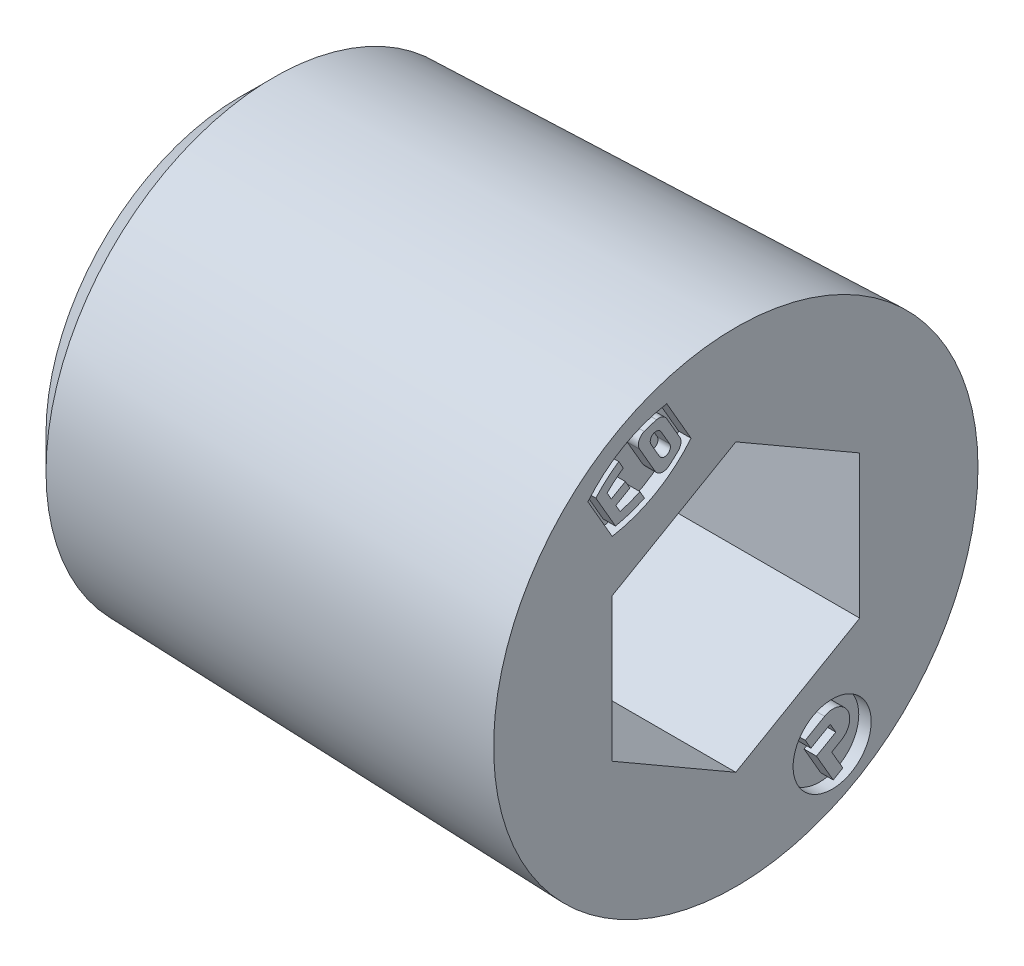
ISO-10303-21;
HEADER;
FILE_DESCRIPTION(('STEP AP214'),'2;1');
FILE_NAME('part.step','',(''),(''),'','','');
FILE_SCHEMA(('AUTOMOTIVE_DESIGN { 1 0 10303 214 1 1 1 1 }'));
ENDSEC;
DATA;
#1=APPLICATION_CONTEXT('core data for automotive mechanical design processes');
#2=APPLICATION_PROTOCOL_DEFINITION('international standard','automotive_design',2000,#1);
#3=PRODUCT_CONTEXT('',#1,'mechanical');
#4=PRODUCT('Part','Part','',(#3));
#5=PRODUCT_RELATED_PRODUCT_CATEGORY('part','',(#4));
#6=PRODUCT_DEFINITION_FORMATION('','',#4);
#7=PRODUCT_DEFINITION_CONTEXT('part definition',#1,'design');
#8=PRODUCT_DEFINITION('design','',#6,#7);
#9=PRODUCT_DEFINITION_SHAPE('','',#8);
#10=(LENGTH_UNIT() NAMED_UNIT(*) SI_UNIT(.MILLI.,.METRE.));
#11=(NAMED_UNIT(*) PLANE_ANGLE_UNIT() SI_UNIT($,.RADIAN.));
#12=(NAMED_UNIT(*) SI_UNIT($,.STERADIAN.) SOLID_ANGLE_UNIT());
#13=UNCERTAINTY_MEASURE_WITH_UNIT(LENGTH_MEASURE(1.E-05),#10,'distance_accuracy_value','');
#14=(GEOMETRIC_REPRESENTATION_CONTEXT(3) GLOBAL_UNCERTAINTY_ASSIGNED_CONTEXT((#13)) GLOBAL_UNIT_ASSIGNED_CONTEXT((#10,
#11,#12)) REPRESENTATION_CONTEXT('',''));
#15=CARTESIAN_POINT('',(0.,0.,0.));
#16=DIRECTION('',(0.,0.,1.));
#17=DIRECTION('',(1.,0.,0.));
#18=AXIS2_PLACEMENT_3D('',#15,#16,#17);
#19=CARTESIAN_POINT('',(0.,-2.47752375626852,-1.56896310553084));
#20=DIRECTION('',(1.,0.,0.));
#21=DIRECTION('',(0.,1.,0.));
#22=AXIS2_PLACEMENT_3D('',#19,#20,#21);
#23=PLANE('',#22);
#24=DIRECTION('',(0.,-0.5,0.866025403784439));
#25=VECTOR('',#24,1.);
#26=CARTESIAN_POINT('',(0.,-2.24369691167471,-1.43396308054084));
#27=LINE('',#26,#25);
#28=CARTESIAN_POINT('',(0.,-2.24369691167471,-1.43396308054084));
#29=VERTEX_POINT('',#28);
#30=CARTESIAN_POINT('',(0.,-2.42369691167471,-1.12219393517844));
#31=VERTEX_POINT('',#30);
#32=EDGE_CURVE('E651',#29,#31,#27,.T.);
#33=ORIENTED_EDGE('',*,*,#32,.T.);
#34=DIRECTION('',(0.,-0.866025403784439,-0.5));
#35=VECTOR('',#34,1.);
#36=CARTESIAN_POINT('',(0.,-2.42369691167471,-1.12219393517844));
#37=LINE('',#36,#35);
#38=CARTESIAN_POINT('',(0.,-2.57958148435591,-1.21219393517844));
#39=VERTEX_POINT('',#38);
#40=EDGE_CURVE('E816',#31,#39,#37,.T.);
#41=ORIENTED_EDGE('',*,*,#40,.T.);
#42=DIRECTION('',(0.,0.5,-0.866025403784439));
#43=VECTOR('',#42,1.);
#44=CARTESIAN_POINT('',(0.,-2.57958148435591,-1.21219393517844));
#45=LINE('',#44,#43);
#46=CARTESIAN_POINT('',(0.,-2.39958148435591,-1.52396308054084));
#47=VERTEX_POINT('',#46);
#48=EDGE_CURVE('E673',#39,#47,#45,.T.);
#49=ORIENTED_EDGE('',*,*,#48,.T.);
#50=DIRECTION('',(0.,-0.866025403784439,-0.5));
#51=VECTOR('',#50,1.);
#52=CARTESIAN_POINT('',(0.,-2.39958148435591,-1.52396308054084));
#53=LINE('',#52,#51);
#54=CARTESIAN_POINT('',(0.,-2.55546605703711,-1.61396308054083));
#55=VERTEX_POINT('',#54);
#56=EDGE_CURVE('E584',#47,#55,#53,.T.);
#57=ORIENTED_EDGE('',*,*,#56,.T.);
#58=DIRECTION('',(0.,-0.5,0.866025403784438));
#59=VECTOR('',#58,1.);
#60=CARTESIAN_POINT('',(0.,-2.55546605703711,-1.61396308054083));
#61=LINE('',#60,#59);
#62=CARTESIAN_POINT('',(0.,-2.73546605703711,-1.30219393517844));
#63=VERTEX_POINT('',#62);
#64=EDGE_CURVE('E629',#55,#63,#61,.T.);
#65=ORIENTED_EDGE('',*,*,#64,.T.);
#66=DIRECTION('',(0.,-0.866025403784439,-0.5));
#67=VECTOR('',#66,1.);
#68=CARTESIAN_POINT('',(0.,-2.73546605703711,-1.30219393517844));
#69=LINE('',#68,#67);
#70=CARTESIAN_POINT('',(0.,-3.20311977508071,-1.57219393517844));
#71=VERTEX_POINT('',#70);
#72=EDGE_CURVE('E628',#63,#71,#69,.T.);
#73=ORIENTED_EDGE('',*,*,#72,.T.);
#74=DIRECTION('',(0.,0.5,-0.866025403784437));
#75=VECTOR('',#74,1.);
#76=CARTESIAN_POINT('',(0.,-3.20311977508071,-1.57219393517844));
#77=LINE('',#76,#75);
#78=CARTESIAN_POINT('',(0.,-3.11311977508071,-1.72807850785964));
#79=VERTEX_POINT('',#78);
#80=EDGE_CURVE('E768',#71,#79,#77,.T.);
#81=ORIENTED_EDGE('',*,*,#80,.T.);
#82=DIRECTION('',(0.,0.866025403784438,0.5));
#83=VECTOR('',#82,1.);
#84=CARTESIAN_POINT('',(0.,-3.11311977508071,-1.72807850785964));
#85=LINE('',#84,#83);
#86=CARTESIAN_POINT('',(0.,-2.80135062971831,-1.54807850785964));
#87=VERTEX_POINT('',#86);
#88=EDGE_CURVE('E884',#79,#87,#85,.T.);
#89=ORIENTED_EDGE('',*,*,#88,.T.);
#90=DIRECTION('',(0.,0.5,-0.866025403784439));
#91=VECTOR('',#90,1.);
#92=CARTESIAN_POINT('',(0.,-2.80135062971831,-1.54807850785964));
#93=LINE('',#92,#91);
#94=CARTESIAN_POINT('',(0.,-2.71135062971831,-1.70396308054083));
#95=VERTEX_POINT('',#94);
#96=EDGE_CURVE('E777',#87,#95,#93,.T.);
#97=ORIENTED_EDGE('',*,*,#96,.T.);
#98=CARTESIAN_POINT('',(0.,-2.47752375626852,-1.56896310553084));
#99=DIRECTION('',(1.,0.,0.));
#100=DIRECTION('',(0.,0.,-1.));
#101=AXIS2_PLACEMENT_3D('',#98,#99,#100);
#102=CIRCLE('',#101,0.27);
#103=EDGE_CURVE('E11',#95,#29,#102,.T.);
#104=ORIENTED_EDGE('',*,*,#103,.T.);
#105=EDGE_LOOP('',(#33,#41,#49,#57,#65,#73,#81,#89,#97,#104));
#106=FACE_BOUND('',#105,.T.);
#107=ADVANCED_FACE('F16',(#106),#23,.T.);
#108=CARTESIAN_POINT('',(-0.2,-2.47752375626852,-1.56896310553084));
#109=DIRECTION('',(-1.,0.,0.));
#110=DIRECTION('',(0.,0.,-1.));
#111=AXIS2_PLACEMENT_3D('',#108,#109,#110);
#112=CYLINDRICAL_SURFACE('',#111,0.27);
#113=ORIENTED_EDGE('',*,*,#103,.F.);
#114=DIRECTION('',(1.,0.,0.));
#115=VECTOR('',#114,1.);
#116=CARTESIAN_POINT('',(-0.2,-2.71135062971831,-1.70396308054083));
#117=LINE('',#116,#115);
#118=CARTESIAN_POINT('',(-0.2,-2.71135062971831,-1.70396308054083));
#119=VERTEX_POINT('',#118);
#120=EDGE_CURVE('E27',#119,#95,#117,.T.);
#121=ORIENTED_EDGE('',*,*,#120,.F.);
#122=CARTESIAN_POINT('',(-0.2,-2.47752375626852,-1.56896310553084));
#123=DIRECTION('',(1.,0.,0.));
#124=DIRECTION('',(0.,0.,-1.));
#125=AXIS2_PLACEMENT_3D('',#122,#123,#124);
#126=CIRCLE('',#125,0.27);
#127=CARTESIAN_POINT('',(-0.2,-2.24369691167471,-1.43396308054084));
#128=VERTEX_POINT('',#127);
#129=EDGE_CURVE('E554',#119,#128,#126,.T.);
#130=ORIENTED_EDGE('',*,*,#129,.T.);
#131=DIRECTION('',(1.,0.,0.));
#132=VECTOR('',#131,1.);
#133=CARTESIAN_POINT('',(-0.2,-2.24369691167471,-1.43396308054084));
#134=LINE('',#133,#132);
#135=EDGE_CURVE('E655',#128,#29,#134,.T.);
#136=ORIENTED_EDGE('',*,*,#135,.T.);
#137=EDGE_LOOP('',(#113,#121,#130,#136));
#138=FACE_BOUND('',#137,.T.);
#139=ADVANCED_FACE('F1005',(#138),#112,.T.);
#140=CARTESIAN_POINT('',(-0.2,-2.80135062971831,-1.54807850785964));
#141=DIRECTION('',(0.,-0.866025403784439,-0.5));
#142=DIRECTION('',(0.,0.5,-0.866025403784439));
#143=AXIS2_PLACEMENT_3D('',#140,#141,#142);
#144=PLANE('',#143);
#145=ORIENTED_EDGE('',*,*,#96,.F.);
#146=DIRECTION('',(1.,0.,0.));
#147=VECTOR('',#146,1.);
#148=CARTESIAN_POINT('',(-0.2,-2.80135062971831,-1.54807850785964));
#149=LINE('',#148,#147);
#150=CARTESIAN_POINT('',(-0.2,-2.80135062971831,-1.54807850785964));
#151=VERTEX_POINT('',#150);
#152=EDGE_CURVE('E781',#151,#87,#149,.T.);
#153=ORIENTED_EDGE('',*,*,#152,.F.);
#154=DIRECTION('',(0.,0.5,-0.866025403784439));
#155=VECTOR('',#154,1.);
#156=CARTESIAN_POINT('',(-0.2,-2.80135062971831,-1.54807850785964));
#157=LINE('',#156,#155);
#158=EDGE_CURVE('E564',#151,#119,#157,.T.);
#159=ORIENTED_EDGE('',*,*,#158,.T.);
#160=ORIENTED_EDGE('',*,*,#120,.T.);
#161=EDGE_LOOP('',(#145,#153,#159,#160));
#162=FACE_BOUND('',#161,.T.);
#163=ADVANCED_FACE('F916',(#162),#144,.T.);
#164=CARTESIAN_POINT('',(-0.2,-3.11311977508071,-1.72807850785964));
#165=DIRECTION('',(0.,0.5,-0.866025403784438));
#166=DIRECTION('',(-1.,0.,0.));
#167=AXIS2_PLACEMENT_3D('',#164,#165,#166);
#168=PLANE('',#167);
#169=ORIENTED_EDGE('',*,*,#88,.F.);
#170=DIRECTION('',(1.,0.,0.));
#171=VECTOR('',#170,1.);
#172=CARTESIAN_POINT('',(-0.2,-3.11311977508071,-1.72807850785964));
#173=LINE('',#172,#171);
#174=CARTESIAN_POINT('',(-0.2,-3.11311977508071,-1.72807850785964));
#175=VERTEX_POINT('',#174);
#176=EDGE_CURVE('E772',#175,#79,#173,.T.);
#177=ORIENTED_EDGE('',*,*,#176,.F.);
#178=DIRECTION('',(0.,0.866025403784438,0.5));
#179=VECTOR('',#178,1.);
#180=CARTESIAN_POINT('',(-0.2,-3.11311977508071,-1.72807850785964));
#181=LINE('',#180,#179);
#182=EDGE_CURVE('E623',#175,#151,#181,.T.);
#183=ORIENTED_EDGE('',*,*,#182,.T.);
#184=ORIENTED_EDGE('',*,*,#152,.T.);
#185=EDGE_LOOP('',(#169,#177,#183,#184));
#186=FACE_BOUND('',#185,.T.);
#187=ADVANCED_FACE('F906',(#186),#168,.T.);
#188=CARTESIAN_POINT('',(-0.2,-3.20311977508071,-1.57219393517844));
#189=DIRECTION('',(0.,-0.866025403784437,-0.5));
#190=DIRECTION('',(0.,0.5,-0.866025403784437));
#191=AXIS2_PLACEMENT_3D('',#188,#189,#190);
#192=PLANE('',#191);
#193=ORIENTED_EDGE('',*,*,#80,.F.);
#194=DIRECTION('',(1.,0.,0.));
#195=VECTOR('',#194,1.);
#196=CARTESIAN_POINT('',(-0.2,-3.20311977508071,-1.57219393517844));
#197=LINE('',#196,#195);
#198=CARTESIAN_POINT('',(-0.2,-3.20311977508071,-1.57219393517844));
#199=VERTEX_POINT('',#198);
#200=EDGE_CURVE('E773',#199,#71,#197,.T.);
#201=ORIENTED_EDGE('',*,*,#200,.F.);
#202=DIRECTION('',(0.,0.5,-0.866025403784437));
#203=VECTOR('',#202,1.);
#204=CARTESIAN_POINT('',(-0.2,-3.20311977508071,-1.57219393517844));
#205=LINE('',#204,#203);
#206=EDGE_CURVE('E583',#199,#175,#205,.T.);
#207=ORIENTED_EDGE('',*,*,#206,.T.);
#208=ORIENTED_EDGE('',*,*,#176,.T.);
#209=EDGE_LOOP('',(#193,#201,#207,#208));
#210=FACE_BOUND('',#209,.T.);
#211=ADVANCED_FACE('F1015',(#210),#192,.T.);
#212=CARTESIAN_POINT('',(-0.2,-2.73546605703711,-1.30219393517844));
#213=DIRECTION('',(0.,-0.5,0.866025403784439));
#214=DIRECTION('',(-1.,0.,0.));
#215=AXIS2_PLACEMENT_3D('',#212,#213,#214);
#216=PLANE('',#215);
#217=ORIENTED_EDGE('',*,*,#72,.F.);
#218=DIRECTION('',(1.,0.,0.));
#219=VECTOR('',#218,1.);
#220=CARTESIAN_POINT('',(-0.2,-2.73546605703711,-1.30219393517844));
#221=LINE('',#220,#219);
#222=CARTESIAN_POINT('',(-0.2,-2.73546605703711,-1.30219393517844));
#223=VERTEX_POINT('',#222);
#224=EDGE_CURVE('E624',#223,#63,#221,.T.);
#225=ORIENTED_EDGE('',*,*,#224,.F.);
#226=DIRECTION('',(0.,-0.866025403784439,-0.5));
#227=VECTOR('',#226,1.);
#228=CARTESIAN_POINT('',(-0.2,-2.73546605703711,-1.30219393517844));
#229=LINE('',#228,#227);
#230=EDGE_CURVE('E578',#223,#199,#229,.T.);
#231=ORIENTED_EDGE('',*,*,#230,.T.);
#232=ORIENTED_EDGE('',*,*,#200,.T.);
#233=EDGE_LOOP('',(#217,#225,#231,#232));
#234=FACE_BOUND('',#233,.T.);
#235=ADVANCED_FACE('F1011',(#234),#216,.T.);
#236=CARTESIAN_POINT('',(-0.2,-2.55546605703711,-1.61396308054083));
#237=DIRECTION('',(0.,0.866025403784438,0.5));
#238=DIRECTION('',(1.,0.,0.));
#239=AXIS2_PLACEMENT_3D('',#236,#237,#238);
#240=PLANE('',#239);
#241=ORIENTED_EDGE('',*,*,#64,.F.);
#242=DIRECTION('',(1.,0.,0.));
#243=VECTOR('',#242,1.);
#244=CARTESIAN_POINT('',(-0.2,-2.55546605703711,-1.61396308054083));
#245=LINE('',#244,#243);
#246=CARTESIAN_POINT('',(-0.2,-2.55546605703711,-1.61396308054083));
#247=VERTEX_POINT('',#246);
#248=EDGE_CURVE('E588',#247,#55,#245,.T.);
#249=ORIENTED_EDGE('',*,*,#248,.F.);
#250=DIRECTION('',(0.,-0.5,0.866025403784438));
#251=VECTOR('',#250,1.);
#252=CARTESIAN_POINT('',(-0.2,-2.55546605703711,-1.61396308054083));
#253=LINE('',#252,#251);
#254=EDGE_CURVE('E582',#247,#223,#253,.T.);
#255=ORIENTED_EDGE('',*,*,#254,.T.);
#256=ORIENTED_EDGE('',*,*,#224,.T.);
#257=EDGE_LOOP('',(#241,#249,#255,#256));
#258=FACE_BOUND('',#257,.T.);
#259=ADVANCED_FACE('F1014',(#258),#240,.T.);
#260=CARTESIAN_POINT('',(-0.2,-2.39958148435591,-1.52396308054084));
#261=DIRECTION('',(0.,-0.5,0.866025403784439));
#262=DIRECTION('',(-1.,0.,0.));
#263=AXIS2_PLACEMENT_3D('',#260,#261,#262);
#264=PLANE('',#263);
#265=ORIENTED_EDGE('',*,*,#56,.F.);
#266=DIRECTION('',(1.,0.,0.));
#267=VECTOR('',#266,1.);
#268=CARTESIAN_POINT('',(-0.2,-2.39958148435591,-1.52396308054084));
#269=LINE('',#268,#267);
#270=CARTESIAN_POINT('',(-0.2,-2.39958148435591,-1.52396308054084));
#271=VERTEX_POINT('',#270);
#272=EDGE_CURVE('E589',#271,#47,#269,.T.);
#273=ORIENTED_EDGE('',*,*,#272,.F.);
#274=DIRECTION('',(0.,-0.866025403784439,-0.5));
#275=VECTOR('',#274,1.);
#276=CARTESIAN_POINT('',(-0.2,-2.39958148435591,-1.52396308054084));
#277=LINE('',#276,#275);
#278=EDGE_CURVE('E647',#271,#247,#277,.T.);
#279=ORIENTED_EDGE('',*,*,#278,.T.);
#280=ORIENTED_EDGE('',*,*,#248,.T.);
#281=EDGE_LOOP('',(#265,#273,#279,#280));
#282=FACE_BOUND('',#281,.T.);
#283=ADVANCED_FACE('F1053',(#282),#264,.T.);
#284=CARTESIAN_POINT('',(-0.2,-2.57958148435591,-1.21219393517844));
#285=DIRECTION('',(0.,-0.866025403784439,-0.5));
#286=DIRECTION('',(0.,0.5,-0.866025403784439));
#287=AXIS2_PLACEMENT_3D('',#284,#285,#286);
#288=PLANE('',#287);
#289=ORIENTED_EDGE('',*,*,#48,.F.);
#290=DIRECTION('',(1.,0.,0.));
#291=VECTOR('',#290,1.);
#292=CARTESIAN_POINT('',(-0.2,-2.57958148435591,-1.21219393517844));
#293=LINE('',#292,#291);
#294=CARTESIAN_POINT('',(-0.2,-2.57958148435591,-1.21219393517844));
#295=VERTEX_POINT('',#294);
#296=EDGE_CURVE('E677',#295,#39,#293,.T.);
#297=ORIENTED_EDGE('',*,*,#296,.F.);
#298=DIRECTION('',(0.,0.5,-0.866025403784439));
#299=VECTOR('',#298,1.);
#300=CARTESIAN_POINT('',(-0.2,-2.57958148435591,-1.21219393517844));
#301=LINE('',#300,#299);
#302=EDGE_CURVE('E724',#295,#271,#301,.T.);
#303=ORIENTED_EDGE('',*,*,#302,.T.);
#304=ORIENTED_EDGE('',*,*,#272,.T.);
#305=EDGE_LOOP('',(#289,#297,#303,#304));
#306=FACE_BOUND('',#305,.T.);
#307=ADVANCED_FACE('F1056',(#306),#288,.T.);
#308=CARTESIAN_POINT('',(-0.2,-2.42369691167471,-1.12219393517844));
#309=DIRECTION('',(0.,-0.5,0.866025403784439));
#310=DIRECTION('',(-1.,0.,0.));
#311=AXIS2_PLACEMENT_3D('',#308,#309,#310);
#312=PLANE('',#311);
#313=ORIENTED_EDGE('',*,*,#40,.F.);
#314=DIRECTION('',(1.,0.,0.));
#315=VECTOR('',#314,1.);
#316=CARTESIAN_POINT('',(-0.2,-2.42369691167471,-1.12219393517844));
#317=LINE('',#316,#315);
#318=CARTESIAN_POINT('',(-0.2,-2.42369691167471,-1.12219393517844));
#319=VERTEX_POINT('',#318);
#320=EDGE_CURVE('E717',#319,#31,#317,.T.);
#321=ORIENTED_EDGE('',*,*,#320,.F.);
#322=DIRECTION('',(0.,-0.866025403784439,-0.5));
#323=VECTOR('',#322,1.);
#324=CARTESIAN_POINT('',(-0.2,-2.42369691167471,-1.12219393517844));
#325=LINE('',#324,#323);
#326=EDGE_CURVE('E656',#319,#295,#325,.T.);
#327=ORIENTED_EDGE('',*,*,#326,.T.);
#328=ORIENTED_EDGE('',*,*,#296,.T.);
#329=EDGE_LOOP('',(#313,#321,#327,#328));
#330=FACE_BOUND('',#329,.T.);
#331=ADVANCED_FACE('F1135',(#330),#312,.T.);
#332=CARTESIAN_POINT('',(-0.2,-2.24369691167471,-1.43396308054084));
#333=DIRECTION('',(0.,0.866025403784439,0.5));
#334=DIRECTION('',(1.,0.,0.));
#335=AXIS2_PLACEMENT_3D('',#332,#333,#334);
#336=PLANE('',#335);
#337=ORIENTED_EDGE('',*,*,#32,.F.);
#338=ORIENTED_EDGE('',*,*,#135,.F.);
#339=DIRECTION('',(0.,-0.5,0.866025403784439));
#340=VECTOR('',#339,1.);
#341=CARTESIAN_POINT('',(-0.2,-2.24369691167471,-1.43396308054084));
#342=LINE('',#341,#340);
#343=EDGE_CURVE('E550',#128,#319,#342,.T.);
#344=ORIENTED_EDGE('',*,*,#343,.T.);
#345=ORIENTED_EDGE('',*,*,#320,.T.);
#346=EDGE_LOOP('',(#337,#338,#344,#345));
#347=FACE_BOUND('',#346,.T.);
#348=ADVANCED_FACE('F1132',(#347),#336,.T.);
#349=CARTESIAN_POINT('',(-0.2,-2.69340834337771,-1.5550400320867));
#350=DIRECTION('',(1.,0.,0.));
#351=DIRECTION('',(0.,1.,0.));
#352=AXIS2_PLACEMENT_3D('',#349,#350,#351);
#353=PLANE('',#352);
#354=ORIENTED_EDGE('',*,*,#343,.F.);
#355=ORIENTED_EDGE('',*,*,#129,.F.);
#356=ORIENTED_EDGE('',*,*,#158,.F.);
#357=ORIENTED_EDGE('',*,*,#182,.F.);
#358=ORIENTED_EDGE('',*,*,#206,.F.);
#359=ORIENTED_EDGE('',*,*,#230,.F.);
#360=ORIENTED_EDGE('',*,*,#254,.F.);
#361=ORIENTED_EDGE('',*,*,#278,.F.);
#362=ORIENTED_EDGE('',*,*,#302,.F.);
#363=ORIENTED_EDGE('',*,*,#326,.F.);
#364=EDGE_LOOP('',(#354,#355,#356,#357,#358,#359,#360,#361,#362,#363));
#365=FACE_BOUND('',#364,.T.);
#366=CARTESIAN_POINT('',(-0.2,-2.69340834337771,-1.5550400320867));
#367=DIRECTION('',(1.,0.,0.));
#368=DIRECTION('',(0.,0.,-1.));
#369=AXIS2_PLACEMENT_3D('',#366,#367,#368);
#370=CIRCLE('',#369,0.63);
#371=CARTESIAN_POINT('',(-0.2,-2.69340834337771,-2.1850400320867));
#372=VERTEX_POINT('',#371);
#373=EDGE_CURVE('E555',#372,#372,#370,.T.);
#374=ORIENTED_EDGE('',*,*,#373,.T.);
#375=EDGE_LOOP('',(#374));
#376=FACE_BOUND('',#375,.T.);
#377=ADVANCED_FACE('F913',(#365,#376),#353,.T.);
#378=CARTESIAN_POINT('',(-0.2,-2.69340834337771,-1.5550400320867));
#379=DIRECTION('',(-1.,0.,0.));
#380=DIRECTION('',(0.,0.,-1.));
#381=AXIS2_PLACEMENT_3D('',#378,#379,#380);
#382=CYLINDRICAL_SURFACE('',#381,0.63);
#383=ORIENTED_EDGE('',*,*,#373,.F.);
#384=EDGE_LOOP('',(#383));
#385=FACE_BOUND('',#384,.T.);
#386=CARTESIAN_POINT('',(0.,-2.69340834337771,-1.5550400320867));
#387=DIRECTION('',(1.,0.,0.));
#388=DIRECTION('',(0.,0.,-1.));
#389=AXIS2_PLACEMENT_3D('',#386,#387,#388);
#390=CIRCLE('',#389,0.63);
#391=CARTESIAN_POINT('',(0.,-2.69340834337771,-2.1850400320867));
#392=VERTEX_POINT('',#391);
#393=EDGE_CURVE('E751',#392,#392,#390,.T.);
#394=ORIENTED_EDGE('',*,*,#393,.T.);
#395=EDGE_LOOP('',(#394));
#396=FACE_BOUND('',#395,.T.);
#397=ADVANCED_FACE('F1118',(#385,#396),#382,.F.);
#398=CARTESIAN_POINT('',(-0.2,1.3294183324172,0.767540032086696));
#399=DIRECTION('',(1.,0.,0.));
#400=DIRECTION('',(0.,1.,0.));
#401=AXIS2_PLACEMENT_3D('',#398,#399,#400);
#402=PLANE('',#401);
#403=CARTESIAN_POINT('',(-0.2,2.76944587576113,1.15033916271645));
#404=DIRECTION('',(1.,0.,0.));
#405=DIRECTION('',(0.,0.,-1.));
#406=AXIS2_PLACEMENT_3D('',#403,#404,#405);
#407=CIRCLE('',#406,0.0945);
#408=CARTESIAN_POINT('',(-0.2,2.72219587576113,1.23217856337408));
#409=VERTEX_POINT('',#408);
#410=CARTESIAN_POINT('',(-0.2,2.81669587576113,1.06849976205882));
#411=VERTEX_POINT('',#410);
#412=EDGE_CURVE('E556',#409,#411,#407,.T.);
#413=ORIENTED_EDGE('',*,*,#412,.T.);
#414=DIRECTION('',(0.,0.866025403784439,0.5));
#415=VECTOR('',#414,1.);
#416=CARTESIAN_POINT('',(-0.2,2.81669587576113,1.06849976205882));
#417=LINE('',#416,#415);
#418=CARTESIAN_POINT('',(-0.2,3.05312081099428,1.20499976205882));
#419=VERTEX_POINT('',#418);
#420=EDGE_CURVE('E508',#411,#419,#417,.T.);
#421=ORIENTED_EDGE('',*,*,#420,.T.);
#422=CARTESIAN_POINT('',(-0.2,3.00587081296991,1.28683916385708));
#423=DIRECTION('',(1.,0.,0.));
#424=DIRECTION('',(0.,0.,-1.));
#425=AXIS2_PLACEMENT_3D('',#422,#423,#424);
#426=CIRCLE('',#425,0.0945);
#427=CARTESIAN_POINT('',(-0.2,2.95862081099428,1.36867856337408));
#428=VERTEX_POINT('',#427);
#429=EDGE_CURVE('E805',#419,#428,#426,.T.);
#430=ORIENTED_EDGE('',*,*,#429,.T.);
#431=DIRECTION('',(0.,-0.866025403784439,-0.5));
#432=VECTOR('',#431,1.);
#433=CARTESIAN_POINT('',(-0.2,2.95862081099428,1.36867856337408));
#434=LINE('',#433,#432);
#435=EDGE_CURVE('E499',#428,#409,#434,.T.);
#436=ORIENTED_EDGE('',*,*,#435,.T.);
#437=EDGE_LOOP('',(#413,#421,#430,#436));
#438=FACE_BOUND('',#437,.T.);
#439=ADVANCED_FACE('F1121',(#438),#402,.T.);
#440=CARTESIAN_POINT('',(0.,1.32941833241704,0.767540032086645));
#441=DIRECTION('',(1.,0.,0.));
#442=DIRECTION('',(0.,1.,0.));
#443=AXIS2_PLACEMENT_3D('',#440,#441,#442);
#444=PLANE('',#443);
#445=DIRECTION('',(0.,0.866025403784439,0.5));
#446=VECTOR('',#445,1.);
#447=CARTESIAN_POINT('',(0.,2.81669587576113,1.06849976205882));
#448=LINE('',#447,#446);
#449=CARTESIAN_POINT('',(0.,2.81669587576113,1.06849976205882));
#450=VERTEX_POINT('',#449);
#451=CARTESIAN_POINT('',(0.,3.05312081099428,1.20499976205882));
#452=VERTEX_POINT('',#451);
#453=EDGE_CURVE('E509',#450,#452,#448,.T.);
#454=ORIENTED_EDGE('',*,*,#453,.F.);
#455=CARTESIAN_POINT('',(0.,2.76944587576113,1.15033916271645));
#456=DIRECTION('',(1.,0.,0.));
#457=DIRECTION('',(0.,0.,-1.));
#458=AXIS2_PLACEMENT_3D('',#455,#456,#457);
#459=CIRCLE('',#458,0.0945);
#460=CARTESIAN_POINT('',(0.,2.72219587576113,1.23217856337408));
#461=VERTEX_POINT('',#460);
#462=EDGE_CURVE('E560',#461,#450,#459,.T.);
#463=ORIENTED_EDGE('',*,*,#462,.F.);
#464=DIRECTION('',(0.,-0.866025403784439,-0.5));
#465=VECTOR('',#464,1.);
#466=CARTESIAN_POINT('',(0.,2.95862081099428,1.36867856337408));
#467=LINE('',#466,#465);
#468=CARTESIAN_POINT('',(0.,2.95862081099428,1.36867856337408));
#469=VERTEX_POINT('',#468);
#470=EDGE_CURVE('E503',#469,#461,#467,.T.);
#471=ORIENTED_EDGE('',*,*,#470,.F.);
#472=CARTESIAN_POINT('',(0.,3.00587081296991,1.28683916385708));
#473=DIRECTION('',(1.,0.,0.));
#474=DIRECTION('',(0.,0.,-1.));
#475=AXIS2_PLACEMENT_3D('',#472,#473,#474);
#476=CIRCLE('',#475,0.0945);
#477=EDGE_CURVE('E802',#452,#469,#476,.T.);
#478=ORIENTED_EDGE('',*,*,#477,.F.);
#479=EDGE_LOOP('',(#454,#463,#471,#478));
#480=FACE_BOUND('',#479,.T.);
#481=CARTESIAN_POINT('',(0.,1.32941833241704,0.767540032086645));
#482=DIRECTION('',(1.,0.,0.));
#483=DIRECTION('',(0.,0.,-1.));
#484=AXIS2_PLACEMENT_3D('',#481,#482,#483);
#485=CIRCLE('',#484,1.995);
#486=CARTESIAN_POINT('',(0.,3.25779437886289,1.27880397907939));
#487=VERTEX_POINT('',#486);
#488=CARTESIAN_POINT('',(0.,3.19382783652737,1.47747115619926));
#489=VERTEX_POINT('',#488);
#490=EDGE_CURVE('E694',#487,#489,#485,.T.);
#491=ORIENTED_EDGE('',*,*,#490,.T.);
#492=CARTESIAN_POINT('',(0.,3.05645029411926,1.42516044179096));
#493=DIRECTION('',(1.,0.,0.));
#494=DIRECTION('',(0.,0.,-1.));
#495=AXIS2_PLACEMENT_3D('',#492,#493,#494);
#496=CIRCLE('',#495,0.147);
#497=CARTESIAN_POINT('',(0.,2.98295029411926,1.55246617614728));
#498=VERTEX_POINT('',#497);
#499=EDGE_CURVE('E485',#489,#498,#496,.T.);
#500=ORIENTED_EDGE('',*,*,#499,.T.);
#501=DIRECTION('',(0.,-0.866025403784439,-0.5));
#502=VECTOR('',#501,1.);
#503=CARTESIAN_POINT('',(0.,2.98295029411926,1.55246617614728));
#504=LINE('',#503,#502);
#505=CARTESIAN_POINT('',(0.,2.55086639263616,1.3030024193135));
#506=VERTEX_POINT('',#505);
#507=EDGE_CURVE('E525',#498,#506,#504,.T.);
#508=ORIENTED_EDGE('',*,*,#507,.T.);
#509=CARTESIAN_POINT('',(0.,2.62436639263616,1.17569668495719));
#510=DIRECTION('',(1.,0.,0.));
#511=DIRECTION('',(0.,0.,-1.));
#512=AXIS2_PLACEMENT_3D('',#509,#510,#511);
#513=CIRCLE('',#512,0.147);
#514=CARTESIAN_POINT('',(0.,2.51037520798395,1.08287960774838));
#515=VERTEX_POINT('',#514);
#516=EDGE_CURVE('E638',#506,#515,#513,.T.);
#517=ORIENTED_EDGE('',*,*,#516,.T.);
#518=CARTESIAN_POINT('',(0.,4.05739835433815,2.34254003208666));
#519=DIRECTION('',(1.,0.,0.));
#520=DIRECTION('',(0.,0.,-1.));
#521=AXIS2_PLACEMENT_3D('',#518,#519,#520);
#522=CIRCLE('',#521,1.995);
#523=CARTESIAN_POINT('',(0.,2.65044276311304,0.92814936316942));
#524=VERTEX_POINT('',#523);
#525=EDGE_CURVE('E849',#515,#524,#522,.T.);
#526=ORIENTED_EDGE('',*,*,#525,.T.);
#527=CARTESIAN_POINT('',(0.,2.75411317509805,1.03236762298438));
#528=DIRECTION('',(1.,0.,0.));
#529=DIRECTION('',(0.,0.,-1.));
#530=AXIS2_PLACEMENT_3D('',#527,#528,#529);
#531=CIRCLE('',#530,0.147);
#532=CARTESIAN_POINT('',(0.,2.82761317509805,0.905061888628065));
#533=VERTEX_POINT('',#532);
#534=EDGE_CURVE('E125',#524,#533,#531,.T.);
#535=ORIENTED_EDGE('',*,*,#534,.T.);
#536=DIRECTION('',(0.,0.866025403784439,0.5));
#537=VECTOR('',#536,1.);
#538=CARTESIAN_POINT('',(0.,2.82761317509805,0.905061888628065));
#539=LINE('',#538,#537);
#540=CARTESIAN_POINT('',(0.,3.18920351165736,1.11382616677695));
#541=VERTEX_POINT('',#540);
#542=EDGE_CURVE('E110',#533,#541,#539,.T.);
#543=ORIENTED_EDGE('',*,*,#542,.T.);
#544=CARTESIAN_POINT('',(0.,3.11570351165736,1.24113190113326));
#545=DIRECTION('',(1.,0.,0.));
#546=DIRECTION('',(0.,0.,-1.));
#547=AXIS2_PLACEMENT_3D('',#544,#545,#546);
#548=CIRCLE('',#547,0.147);
#549=EDGE_CURVE('E764',#541,#487,#548,.T.);
#550=ORIENTED_EDGE('',*,*,#549,.T.);
#551=EDGE_LOOP('',(#491,#500,#508,#517,#526,#535,#543,#550));
#552=FACE_BOUND('',#551,.T.);
#553=ADVANCED_FACE('F951',(#480,#552),#444,.T.);
#554=CARTESIAN_POINT('',(-0.2,3.11570351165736,1.24113190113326));
#555=DIRECTION('',(-1.,0.,0.));
#556=DIRECTION('',(0.,0.,-1.));
#557=AXIS2_PLACEMENT_3D('',#554,#555,#556);
#558=CYLINDRICAL_SURFACE('',#557,0.147);
#559=ORIENTED_EDGE('',*,*,#549,.F.);
#560=DIRECTION('',(1.,0.,0.));
#561=VECTOR('',#560,1.);
#562=CARTESIAN_POINT('',(-0.2,3.18920351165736,1.11382616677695));
#563=LINE('',#562,#561);
#564=CARTESIAN_POINT('',(-0.2,3.18920351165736,1.11382616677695));
#565=VERTEX_POINT('',#564);
#566=EDGE_CURVE('E548',#565,#541,#563,.T.);
#567=ORIENTED_EDGE('',*,*,#566,.F.);
#568=CARTESIAN_POINT('',(-0.2,3.11570351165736,1.24113190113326));
#569=DIRECTION('',(1.,0.,0.));
#570=DIRECTION('',(0.,0.,-1.));
#571=AXIS2_PLACEMENT_3D('',#568,#569,#570);
#572=CIRCLE('',#571,0.147);
#573=CARTESIAN_POINT('',(-0.2,3.25779437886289,1.27880397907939));
#574=VERTEX_POINT('',#573);
#575=EDGE_CURVE('E540',#565,#574,#572,.T.);
#576=ORIENTED_EDGE('',*,*,#575,.T.);
#577=DIRECTION('',(1.,0.,0.));
#578=VECTOR('',#577,1.);
#579=CARTESIAN_POINT('',(-0.2,3.25779437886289,1.27880397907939));
#580=LINE('',#579,#578);
#581=EDGE_CURVE('E698',#574,#487,#580,.T.);
#582=ORIENTED_EDGE('',*,*,#581,.T.);
#583=EDGE_LOOP('',(#559,#567,#576,#582));
#584=FACE_BOUND('',#583,.T.);
#585=ADVANCED_FACE('F1065',(#584),#558,.T.);
#586=CARTESIAN_POINT('',(-0.2,3.00587081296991,1.28683916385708));
#587=DIRECTION('',(-1.,0.,0.));
#588=DIRECTION('',(0.,0.,-1.));
#589=AXIS2_PLACEMENT_3D('',#586,#587,#588);
#590=CYLINDRICAL_SURFACE('',#589,0.0945);
#591=ORIENTED_EDGE('',*,*,#477,.T.);
#592=DIRECTION('',(1.,0.,0.));
#593=VECTOR('',#592,1.);
#594=CARTESIAN_POINT('',(-0.2,2.95862081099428,1.36867856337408));
#595=LINE('',#594,#593);
#596=EDGE_CURVE('E502',#428,#469,#595,.T.);
#597=ORIENTED_EDGE('',*,*,#596,.F.);
#598=ORIENTED_EDGE('',*,*,#429,.F.);
#599=DIRECTION('',(1.,0.,0.));
#600=VECTOR('',#599,1.);
#601=CARTESIAN_POINT('',(-0.2,3.05312081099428,1.20499976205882));
#602=LINE('',#601,#600);
#603=EDGE_CURVE('E504',#419,#452,#602,.T.);
#604=ORIENTED_EDGE('',*,*,#603,.T.);
#605=EDGE_LOOP('',(#591,#597,#598,#604));
#606=FACE_BOUND('',#605,.T.);
#607=ADVANCED_FACE('F1061',(#606),#590,.F.);
#608=CARTESIAN_POINT('',(-0.2,2.95862081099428,1.36867856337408));
#609=DIRECTION('',(0.,-0.5,0.866025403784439));
#610=DIRECTION('',(-1.,0.,0.));
#611=AXIS2_PLACEMENT_3D('',#608,#609,#610);
#612=PLANE('',#611);
#613=ORIENTED_EDGE('',*,*,#470,.T.);
#614=DIRECTION('',(1.,0.,0.));
#615=VECTOR('',#614,1.);
#616=CARTESIAN_POINT('',(-0.2,2.72219587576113,1.23217856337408));
#617=LINE('',#616,#615);
#618=EDGE_CURVE('E559',#409,#461,#617,.T.);
#619=ORIENTED_EDGE('',*,*,#618,.F.);
#620=ORIENTED_EDGE('',*,*,#435,.F.);
#621=ORIENTED_EDGE('',*,*,#596,.T.);
#622=EDGE_LOOP('',(#613,#619,#620,#621));
#623=FACE_BOUND('',#622,.T.);
#624=ADVANCED_FACE('F1064',(#623),#612,.F.);
#625=CARTESIAN_POINT('',(-0.2,2.76944587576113,1.15033916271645));
#626=DIRECTION('',(-1.,0.,0.));
#627=DIRECTION('',(0.,0.,-1.));
#628=AXIS2_PLACEMENT_3D('',#625,#626,#627);
#629=CYLINDRICAL_SURFACE('',#628,0.0945);
#630=ORIENTED_EDGE('',*,*,#462,.T.);
#631=DIRECTION('',(1.,0.,0.));
#632=VECTOR('',#631,1.);
#633=CARTESIAN_POINT('',(-0.2,2.81669587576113,1.06849976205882));
#634=LINE('',#633,#632);
#635=EDGE_CURVE('E752',#411,#450,#634,.T.);
#636=ORIENTED_EDGE('',*,*,#635,.F.);
#637=ORIENTED_EDGE('',*,*,#412,.F.);
#638=ORIENTED_EDGE('',*,*,#618,.T.);
#639=EDGE_LOOP('',(#630,#636,#637,#638));
#640=FACE_BOUND('',#639,.T.);
#641=ADVANCED_FACE('F1040',(#640),#629,.F.);
#642=CARTESIAN_POINT('',(-0.2,2.81669587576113,1.06849976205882));
#643=DIRECTION('',(0.,0.5,-0.866025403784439));
#644=DIRECTION('',(-1.,0.,0.));
#645=AXIS2_PLACEMENT_3D('',#642,#643,#644);
#646=PLANE('',#645);
#647=ORIENTED_EDGE('',*,*,#453,.T.);
#648=ORIENTED_EDGE('',*,*,#603,.F.);
#649=ORIENTED_EDGE('',*,*,#420,.F.);
#650=ORIENTED_EDGE('',*,*,#635,.T.);
#651=EDGE_LOOP('',(#647,#648,#649,#650));
#652=FACE_BOUND('',#651,.T.);
#653=ADVANCED_FACE('F1036',(#652),#646,.F.);
#654=CARTESIAN_POINT('',(-0.2,2.82761317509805,0.905061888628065));
#655=DIRECTION('',(0.,0.5,-0.866025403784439));
#656=DIRECTION('',(-1.,0.,0.));
#657=AXIS2_PLACEMENT_3D('',#654,#655,#656);
#658=PLANE('',#657);
#659=ORIENTED_EDGE('',*,*,#542,.F.);
#660=DIRECTION('',(1.,0.,0.));
#661=VECTOR('',#660,1.);
#662=CARTESIAN_POINT('',(-0.2,2.82761317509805,0.905061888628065));
#663=LINE('',#662,#661);
#664=CARTESIAN_POINT('',(-0.2,2.82761317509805,0.905061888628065));
#665=VERTEX_POINT('',#664);
#666=EDGE_CURVE('E549',#665,#533,#663,.T.);
#667=ORIENTED_EDGE('',*,*,#666,.F.);
#668=DIRECTION('',(0.,0.866025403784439,0.5));
#669=VECTOR('',#668,1.);
#670=CARTESIAN_POINT('',(-0.2,2.82761317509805,0.905061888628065));
#671=LINE('',#670,#669);
#672=EDGE_CURVE('E544',#665,#565,#671,.T.);
#673=ORIENTED_EDGE('',*,*,#672,.T.);
#674=ORIENTED_EDGE('',*,*,#566,.T.);
#675=EDGE_LOOP('',(#659,#667,#673,#674));
#676=FACE_BOUND('',#675,.T.);
#677=ADVANCED_FACE('F1039',(#676),#658,.T.);
#678=CARTESIAN_POINT('',(-0.2,2.75411317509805,1.03236762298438));
#679=DIRECTION('',(-1.,0.,0.));
#680=DIRECTION('',(0.,0.,-1.));
#681=AXIS2_PLACEMENT_3D('',#678,#679,#680);
#682=CYLINDRICAL_SURFACE('',#681,0.147);
#683=ORIENTED_EDGE('',*,*,#534,.F.);
#684=DIRECTION('',(1.,0.,0.));
#685=VECTOR('',#684,1.);
#686=CARTESIAN_POINT('',(-0.2,2.65044276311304,0.92814936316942));
#687=LINE('',#686,#685);
#688=CARTESIAN_POINT('',(-0.2,2.65044276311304,0.92814936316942));
#689=VERTEX_POINT('',#688);
#690=EDGE_CURVE('E686',#689,#524,#687,.T.);
#691=ORIENTED_EDGE('',*,*,#690,.F.);
#692=CARTESIAN_POINT('',(-0.2,2.75411317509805,1.03236762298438));
#693=DIRECTION('',(1.,0.,0.));
#694=DIRECTION('',(0.,0.,-1.));
#695=AXIS2_PLACEMENT_3D('',#692,#693,#694);
#696=CIRCLE('',#695,0.147);
#697=EDGE_CURVE('E496',#689,#665,#696,.T.);
#698=ORIENTED_EDGE('',*,*,#697,.T.);
#699=ORIENTED_EDGE('',*,*,#666,.T.);
#700=EDGE_LOOP('',(#683,#691,#698,#699));
#701=FACE_BOUND('',#700,.T.);
#702=ADVANCED_FACE('F1085',(#701),#682,.T.);
#703=CARTESIAN_POINT('',(-0.2,4.05739835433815,2.34254003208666));
#704=DIRECTION('',(-1.,0.,0.));
#705=DIRECTION('',(0.,0.,-1.));
#706=AXIS2_PLACEMENT_3D('',#703,#704,#705);
#707=CYLINDRICAL_SURFACE('',#706,1.995);
#708=ORIENTED_EDGE('',*,*,#525,.F.);
#709=DIRECTION('',(1.,0.,0.));
#710=VECTOR('',#709,1.);
#711=CARTESIAN_POINT('',(-0.2,2.51037520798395,1.08287960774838));
#712=LINE('',#711,#710);
#713=CARTESIAN_POINT('',(-0.2,2.51037520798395,1.08287960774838));
#714=VERTEX_POINT('',#713);
#715=EDGE_CURVE('E642',#714,#515,#712,.T.);
#716=ORIENTED_EDGE('',*,*,#715,.F.);
#717=CARTESIAN_POINT('',(-0.2,4.05739835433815,2.34254003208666));
#718=DIRECTION('',(1.,0.,0.));
#719=DIRECTION('',(0.,0.,-1.));
#720=AXIS2_PLACEMENT_3D('',#717,#718,#719);
#721=CIRCLE('',#720,1.995);
#722=EDGE_CURVE('E491',#714,#689,#721,.T.);
#723=ORIENTED_EDGE('',*,*,#722,.T.);
#724=ORIENTED_EDGE('',*,*,#690,.T.);
#725=EDGE_LOOP('',(#708,#716,#723,#724));
#726=FACE_BOUND('',#725,.T.);
#727=ADVANCED_FACE('F1044',(#726),#707,.T.);
#728=CARTESIAN_POINT('',(-0.2,2.62436639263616,1.17569668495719));
#729=DIRECTION('',(-1.,0.,0.));
#730=DIRECTION('',(0.,0.,-1.));
#731=AXIS2_PLACEMENT_3D('',#728,#729,#730);
#732=CYLINDRICAL_SURFACE('',#731,0.147);
#733=ORIENTED_EDGE('',*,*,#516,.F.);
#734=DIRECTION('',(1.,0.,0.));
#735=VECTOR('',#734,1.);
#736=CARTESIAN_POINT('',(-0.2,2.55086639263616,1.3030024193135));
#737=LINE('',#736,#735);
#738=CARTESIAN_POINT('',(-0.2,2.55086639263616,1.3030024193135));
#739=VERTEX_POINT('',#738);
#740=EDGE_CURVE('E643',#739,#506,#737,.T.);
#741=ORIENTED_EDGE('',*,*,#740,.F.);
#742=CARTESIAN_POINT('',(-0.2,2.62436639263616,1.17569668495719));
#743=DIRECTION('',(1.,0.,0.));
#744=DIRECTION('',(0.,0.,-1.));
#745=AXIS2_PLACEMENT_3D('',#742,#743,#744);
#746=CIRCLE('',#745,0.147);
#747=EDGE_CURVE('E495',#739,#714,#746,.T.);
#748=ORIENTED_EDGE('',*,*,#747,.T.);
#749=ORIENTED_EDGE('',*,*,#715,.T.);
#750=EDGE_LOOP('',(#733,#741,#748,#749));
#751=FACE_BOUND('',#750,.T.);
#752=ADVANCED_FACE('F1030',(#751),#732,.T.);
#753=CARTESIAN_POINT('',(-0.2,2.98295029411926,1.55246617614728));
#754=DIRECTION('',(0.,-0.5,0.866025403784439));
#755=DIRECTION('',(-1.,0.,0.));
#756=AXIS2_PLACEMENT_3D('',#753,#754,#755);
#757=PLANE('',#756);
#758=ORIENTED_EDGE('',*,*,#507,.F.);
#759=DIRECTION('',(1.,0.,0.));
#760=VECTOR('',#759,1.);
#761=CARTESIAN_POINT('',(-0.2,2.98295029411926,1.55246617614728));
#762=LINE('',#761,#760);
#763=CARTESIAN_POINT('',(-0.2,2.98295029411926,1.55246617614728));
#764=VERTEX_POINT('',#763);
#765=EDGE_CURVE('E489',#764,#498,#762,.T.);
#766=ORIENTED_EDGE('',*,*,#765,.F.);
#767=DIRECTION('',(0.,-0.866025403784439,-0.5));
#768=VECTOR('',#767,1.);
#769=CARTESIAN_POINT('',(-0.2,2.98295029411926,1.55246617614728));
#770=LINE('',#769,#768);
#771=EDGE_CURVE('E711',#764,#739,#770,.T.);
#772=ORIENTED_EDGE('',*,*,#771,.T.);
#773=ORIENTED_EDGE('',*,*,#740,.T.);
#774=EDGE_LOOP('',(#758,#766,#772,#773));
#775=FACE_BOUND('',#774,.T.);
#776=ADVANCED_FACE('F949',(#775),#757,.T.);
#777=CARTESIAN_POINT('',(-0.2,3.05645029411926,1.42516044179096));
#778=DIRECTION('',(-1.,0.,0.));
#779=DIRECTION('',(0.,0.,-1.));
#780=AXIS2_PLACEMENT_3D('',#777,#778,#779);
#781=CYLINDRICAL_SURFACE('',#780,0.147);
#782=ORIENTED_EDGE('',*,*,#499,.F.);
#783=DIRECTION('',(1.,0.,0.));
#784=VECTOR('',#783,1.);
#785=CARTESIAN_POINT('',(-0.2,3.19382783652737,1.47747115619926));
#786=LINE('',#785,#784);
#787=CARTESIAN_POINT('',(-0.2,3.19382783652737,1.47747115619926));
#788=VERTEX_POINT('',#787);
#789=EDGE_CURVE('E490',#788,#489,#786,.T.);
#790=ORIENTED_EDGE('',*,*,#789,.F.);
#791=CARTESIAN_POINT('',(-0.2,3.05645029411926,1.42516044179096));
#792=DIRECTION('',(1.,0.,0.));
#793=DIRECTION('',(0.,0.,-1.));
#794=AXIS2_PLACEMENT_3D('',#791,#792,#793);
#795=CIRCLE('',#794,0.147);
#796=EDGE_CURVE('E683',#788,#764,#795,.T.);
#797=ORIENTED_EDGE('',*,*,#796,.T.);
#798=ORIENTED_EDGE('',*,*,#765,.T.);
#799=EDGE_LOOP('',(#782,#790,#797,#798));
#800=FACE_BOUND('',#799,.T.);
#801=ADVANCED_FACE('F938',(#800),#781,.T.);
#802=CARTESIAN_POINT('',(-0.2,1.32941833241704,0.767540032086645));
#803=DIRECTION('',(-1.,0.,0.));
#804=DIRECTION('',(0.,0.,-1.));
#805=AXIS2_PLACEMENT_3D('',#802,#803,#804);
#806=CYLINDRICAL_SURFACE('',#805,1.995);
#807=ORIENTED_EDGE('',*,*,#490,.F.);
#808=ORIENTED_EDGE('',*,*,#581,.F.);
#809=CARTESIAN_POINT('',(-0.2,1.32941833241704,0.767540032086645));
#810=DIRECTION('',(1.,0.,0.));
#811=DIRECTION('',(0.,0.,-1.));
#812=AXIS2_PLACEMENT_3D('',#809,#810,#811);
#813=CIRCLE('',#812,1.995);
#814=EDGE_CURVE('E545',#574,#788,#813,.T.);
#815=ORIENTED_EDGE('',*,*,#814,.T.);
#816=ORIENTED_EDGE('',*,*,#789,.T.);
#817=EDGE_LOOP('',(#807,#808,#815,#816));
#818=FACE_BOUND('',#817,.T.);
#819=ADVANCED_FACE('F954',(#818),#806,.T.);
#820=CARTESIAN_POINT('',(0.,1.32941833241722,0.767540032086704));
#821=DIRECTION('',(1.,0.,0.));
#822=DIRECTION('',(0.,1.,0.));
#823=AXIS2_PLACEMENT_3D('',#820,#821,#822);
#824=PLANE('',#823);
#825=CARTESIAN_POINT('',(0.,1.32941833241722,0.767540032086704));
#826=DIRECTION('',(1.,0.,0.));
#827=DIRECTION('',(0.,0.,-1.));
#828=AXIS2_PLACEMENT_3D('',#825,#826,#827);
#829=CIRCLE('',#828,1.995);
#830=CARTESIAN_POINT('',(0.,2.97894241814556,1.88963418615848));
#831=VERTEX_POINT('',#830);
#832=CARTESIAN_POINT('',(0.,2.65373030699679,2.2595932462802));
#833=VERTEX_POINT('',#832);
#834=EDGE_CURVE('E747',#831,#833,#829,.T.);
#835=ORIENTED_EDGE('',*,*,#834,.T.);
#836=DIRECTION('',(0.,-0.866025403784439,-0.5));
#837=VECTOR('',#836,1.);
#838=CARTESIAN_POINT('',(0.,2.65373030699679,2.2595932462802));
#839=LINE('',#838,#837);
#840=CARTESIAN_POINT('',(0.,2.10308637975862,1.9416788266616));
#841=VERTEX_POINT('',#840);
#842=EDGE_CURVE('E271',#833,#841,#839,.T.);
#843=ORIENTED_EDGE('',*,*,#842,.T.);
#844=CARTESIAN_POINT('',(0.,4.05739835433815,2.34254003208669));
#845=DIRECTION('',(1.,0.,0.));
#846=DIRECTION('',(0.,0.,-1.));
#847=AXIS2_PLACEMENT_3D('',#844,#845,#846);
#848=CIRCLE('',#847,1.995);
#849=CARTESIAN_POINT('',(0.,2.26087426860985,1.47505734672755));
#850=VERTEX_POINT('',#849);
#851=EDGE_CURVE('E282',#841,#850,#848,.T.);
#852=ORIENTED_EDGE('',*,*,#851,.T.);
#853=DIRECTION('',(0.,0.866025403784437,0.5));
#854=VECTOR('',#853,1.);
#855=CARTESIAN_POINT('',(0.,2.26087426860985,1.47505734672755));
#856=LINE('',#855,#854);
#857=CARTESIAN_POINT('',(0.,2.38855473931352,1.54877370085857));
#858=VERTEX_POINT('',#857);
#859=EDGE_CURVE('E608',#850,#858,#856,.T.);
#860=ORIENTED_EDGE('',*,*,#859,.T.);
#861=CARTESIAN_POINT('',(0.,4.05739835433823,2.34254003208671));
#862=DIRECTION('',(1.,0.,0.));
#863=DIRECTION('',(0.,0.,-1.));
#864=AXIS2_PLACEMENT_3D('',#861,#862,#863);
#865=CIRCLE('',#864,1.848);
#866=CARTESIAN_POINT('',(0.,2.27111317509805,1.86894816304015));
#867=VERTEX_POINT('',#866);
#868=EDGE_CURVE('E595',#867,#858,#865,.T.);
#869=ORIENTED_EDGE('',*,*,#868,.F.);
#870=DIRECTION('',(0.,0.866025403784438,0.5));
#871=VECTOR('',#870,1.);
#872=CARTESIAN_POINT('',(0.,2.27111317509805,1.86894816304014));
#873=LINE('',#872,#871);
#874=CARTESIAN_POINT('',(0.,2.38825547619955,1.93658030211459));
#875=VERTEX_POINT('',#874);
#876=EDGE_CURVE('E594',#867,#875,#873,.T.);
#877=ORIENTED_EDGE('',*,*,#876,.T.);
#878=DIRECTION('',(0.,0.5,-0.866025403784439));
#879=VECTOR('',#878,1.);
#880=CARTESIAN_POINT('',(0.,2.38825547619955,1.93658030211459));
#881=LINE('',#880,#879);
#882=CARTESIAN_POINT('',(0.,2.51950547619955,1.70924863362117));
#883=VERTEX_POINT('',#882);
#884=EDGE_CURVE('E593',#875,#883,#881,.T.);
#885=ORIENTED_EDGE('',*,*,#884,.T.);
#886=DIRECTION('',(0.,0.866025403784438,0.5));
#887=VECTOR('',#886,1.);
#888=CARTESIAN_POINT('',(0.,2.51950547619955,1.70924863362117));
#889=LINE('',#888,#887);
#890=CARTESIAN_POINT('',(0.,2.64681121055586,1.78274863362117));
#891=VERTEX_POINT('',#890);
#892=EDGE_CURVE('E516',#883,#891,#889,.T.);
#893=ORIENTED_EDGE('',*,*,#892,.T.);
#894=DIRECTION('',(0.,-0.5,0.866025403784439));
#895=VECTOR('',#894,1.);
#896=CARTESIAN_POINT('',(0.,2.64681121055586,1.78274863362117));
#897=LINE('',#896,#895);
#898=CARTESIAN_POINT('',(0.,2.51556121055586,2.01008030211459));
#899=VERTEX_POINT('',#898);
#900=EDGE_CURVE('E570',#891,#899,#897,.T.);
#901=ORIENTED_EDGE('',*,*,#900,.T.);
#902=DIRECTION('',(0.,0.86602540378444,0.5));
#903=VECTOR('',#902,1.);
#904=CARTESIAN_POINT('',(0.,2.51556121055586,2.01008030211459));
#905=LINE('',#904,#903);
#906=CARTESIAN_POINT('',(0.,2.63270351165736,2.07771244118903));
#907=VERTEX_POINT('',#906);
#908=EDGE_CURVE('E864',#899,#907,#905,.T.);
#909=ORIENTED_EDGE('',*,*,#908,.T.);
#910=CARTESIAN_POINT('',(0.,1.32941833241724,0.76754003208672));
#911=DIRECTION('',(1.,0.,0.));
#912=DIRECTION('',(0.,0.,-1.));
#913=AXIS2_PLACEMENT_3D('',#910,#911,#912);
#914=CIRCLE('',#913,1.848);
#915=CARTESIAN_POINT('',(0.,2.85126194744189,1.81591783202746));
#916=VERTEX_POINT('',#915);
#917=EDGE_CURVE('E482',#916,#907,#914,.T.);
#918=ORIENTED_EDGE('',*,*,#917,.F.);
#919=DIRECTION('',(0.,0.866025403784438,0.5));
#920=VECTOR('',#919,1.);
#921=CARTESIAN_POINT('',(0.,2.85126194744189,1.81591783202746));
#922=LINE('',#921,#920);
#923=EDGE_CURVE('E699',#916,#831,#922,.T.);
#924=ORIENTED_EDGE('',*,*,#923,.T.);
#925=EDGE_LOOP('',(#835,#843,#852,#860,#869,#877,#885,#893,#901,#909,#918,#924));
#926=FACE_BOUND('',#925,.T.);
#927=ADVANCED_FACE('F1034',(#926),#824,.T.);
#928=CARTESIAN_POINT('',(-0.2,2.85126194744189,1.81591783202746));
#929=DIRECTION('',(0.,0.5,-0.866025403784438));
#930=DIRECTION('',(-1.,0.,0.));
#931=AXIS2_PLACEMENT_3D('',#928,#929,#930);
#932=PLANE('',#931);
#933=ORIENTED_EDGE('',*,*,#923,.F.);
#934=DIRECTION('',(1.,0.,0.));
#935=VECTOR('',#934,1.);
#936=CARTESIAN_POINT('',(-0.2,2.85126194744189,1.81591783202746));
#937=LINE('',#936,#935);
#938=CARTESIAN_POINT('',(-0.2,2.85126194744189,1.81591783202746));
#939=VERTEX_POINT('',#938);
#940=EDGE_CURVE('E484',#939,#916,#937,.T.);
#941=ORIENTED_EDGE('',*,*,#940,.F.);
#942=DIRECTION('',(0.,0.866025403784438,0.5));
#943=VECTOR('',#942,1.);
#944=CARTESIAN_POINT('',(-0.2,2.85126194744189,1.81591783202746));
#945=LINE('',#944,#943);
#946=CARTESIAN_POINT('',(-0.2,2.97894241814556,1.88963418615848));
#947=VERTEX_POINT('',#946);
#948=EDGE_CURVE('E682',#939,#947,#945,.T.);
#949=ORIENTED_EDGE('',*,*,#948,.T.);
#950=DIRECTION('',(1.,0.,0.));
#951=VECTOR('',#950,1.);
#952=CARTESIAN_POINT('',(-0.2,2.97894241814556,1.88963418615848));
#953=LINE('',#952,#951);
#954=EDGE_CURVE('E742',#947,#831,#953,.T.);
#955=ORIENTED_EDGE('',*,*,#954,.T.);
#956=EDGE_LOOP('',(#933,#941,#949,#955));
#957=FACE_BOUND('',#956,.T.);
#958=ADVANCED_FACE('F1031',(#957),#932,.T.);
#959=CARTESIAN_POINT('',(-0.2,1.32941833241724,0.76754003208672));
#960=DIRECTION('',(-1.,0.,0.));
#961=DIRECTION('',(0.,0.,-1.));
#962=AXIS2_PLACEMENT_3D('',#959,#960,#961);
#963=CYLINDRICAL_SURFACE('',#962,1.848);
#964=ORIENTED_EDGE('',*,*,#917,.T.);
#965=DIRECTION('',(1.,0.,0.));
#966=VECTOR('',#965,1.);
#967=CARTESIAN_POINT('',(-0.2,2.63270351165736,2.07771244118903));
#968=LINE('',#967,#966);
#969=CARTESIAN_POINT('',(-0.2,2.63270351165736,2.07771244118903));
#970=VERTEX_POINT('',#969);
#971=EDGE_CURVE('E480',#970,#907,#968,.T.);
#972=ORIENTED_EDGE('',*,*,#971,.F.);
#973=CARTESIAN_POINT('',(-0.2,1.32941833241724,0.76754003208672));
#974=DIRECTION('',(1.,0.,0.));
#975=DIRECTION('',(0.,0.,-1.));
#976=AXIS2_PLACEMENT_3D('',#973,#974,#975);
#977=CIRCLE('',#976,1.848);
#978=EDGE_CURVE('E693',#939,#970,#977,.T.);
#979=ORIENTED_EDGE('',*,*,#978,.F.);
#980=ORIENTED_EDGE('',*,*,#940,.T.);
#981=EDGE_LOOP('',(#964,#972,#979,#980));
#982=FACE_BOUND('',#981,.T.);
#983=ADVANCED_FACE('F1026',(#982),#963,.F.);
#984=CARTESIAN_POINT('',(-0.2,2.51556121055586,2.01008030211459));
#985=DIRECTION('',(0.,0.5,-0.86602540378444));
#986=DIRECTION('',(-1.,0.,0.));
#987=AXIS2_PLACEMENT_3D('',#984,#985,#986);
#988=PLANE('',#987);
#989=ORIENTED_EDGE('',*,*,#908,.F.);
#990=DIRECTION('',(1.,0.,0.));
#991=VECTOR('',#990,1.);
#992=CARTESIAN_POINT('',(-0.2,2.51556121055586,2.01008030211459));
#993=LINE('',#992,#991);
#994=CARTESIAN_POINT('',(-0.2,2.51556121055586,2.01008030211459));
#995=VERTEX_POINT('',#994);
#996=EDGE_CURVE('E574',#995,#899,#993,.T.);
#997=ORIENTED_EDGE('',*,*,#996,.F.);
#998=DIRECTION('',(0.,0.86602540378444,0.5));
#999=VECTOR('',#998,1.);
#1000=CARTESIAN_POINT('',(-0.2,2.51556121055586,2.01008030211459));
#1001=LINE('',#1000,#999);
#1002=EDGE_CURVE('E667',#995,#970,#1001,.T.);
#1003=ORIENTED_EDGE('',*,*,#1002,.T.);
#1004=ORIENTED_EDGE('',*,*,#971,.T.);
#1005=EDGE_LOOP('',(#989,#997,#1003,#1004));
#1006=FACE_BOUND('',#1005,.T.);
#1007=ADVANCED_FACE('F1022',(#1006),#988,.T.);
#1008=CARTESIAN_POINT('',(-0.2,2.64681121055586,1.78274863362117));
#1009=DIRECTION('',(0.,0.866025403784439,0.5));
#1010=DIRECTION('',(1.,0.,0.));
#1011=AXIS2_PLACEMENT_3D('',#1008,#1009,#1010);
#1012=PLANE('',#1011);
#1013=ORIENTED_EDGE('',*,*,#900,.F.);
#1014=DIRECTION('',(1.,0.,0.));
#1015=VECTOR('',#1014,1.);
#1016=CARTESIAN_POINT('',(-0.2,2.64681121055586,1.78274863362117));
#1017=LINE('',#1016,#1015);
#1018=CARTESIAN_POINT('',(-0.2,2.64681121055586,1.78274863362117));
#1019=VERTEX_POINT('',#1018);
#1020=EDGE_CURVE('E520',#1019,#891,#1017,.T.);
#1021=ORIENTED_EDGE('',*,*,#1020,.F.);
#1022=DIRECTION('',(0.,-0.5,0.866025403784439));
#1023=VECTOR('',#1022,1.);
#1024=CARTESIAN_POINT('',(-0.2,2.64681121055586,1.78274863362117));
#1025=LINE('',#1024,#1023);
#1026=EDGE_CURVE('E662',#1019,#995,#1025,.T.);
#1027=ORIENTED_EDGE('',*,*,#1026,.T.);
#1028=ORIENTED_EDGE('',*,*,#996,.T.);
#1029=EDGE_LOOP('',(#1013,#1021,#1027,#1028));
#1030=FACE_BOUND('',#1029,.T.);
#1031=ADVANCED_FACE('F1025',(#1030),#1012,.T.);
#1032=CARTESIAN_POINT('',(-0.2,2.51950547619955,1.70924863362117));
#1033=DIRECTION('',(0.,0.5,-0.866025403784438));
#1034=DIRECTION('',(-1.,0.,0.));
#1035=AXIS2_PLACEMENT_3D('',#1032,#1033,#1034);
#1036=PLANE('',#1035);
#1037=ORIENTED_EDGE('',*,*,#892,.F.);
#1038=DIRECTION('',(1.,0.,0.));
#1039=VECTOR('',#1038,1.);
#1040=CARTESIAN_POINT('',(-0.2,2.51950547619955,1.70924863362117));
#1041=LINE('',#1040,#1039);
#1042=CARTESIAN_POINT('',(-0.2,2.51950547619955,1.70924863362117));
#1043=VERTEX_POINT('',#1042);
#1044=EDGE_CURVE('E521',#1043,#883,#1041,.T.);
#1045=ORIENTED_EDGE('',*,*,#1044,.F.);
#1046=DIRECTION('',(0.,0.866025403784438,0.5));
#1047=VECTOR('',#1046,1.);
#1048=CARTESIAN_POINT('',(-0.2,2.51950547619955,1.70924863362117));
#1049=LINE('',#1048,#1047);
#1050=EDGE_CURVE('E666',#1043,#1019,#1049,.T.);
#1051=ORIENTED_EDGE('',*,*,#1050,.T.);
#1052=ORIENTED_EDGE('',*,*,#1020,.T.);
#1053=EDGE_LOOP('',(#1037,#1045,#1051,#1052));
#1054=FACE_BOUND('',#1053,.T.);
#1055=ADVANCED_FACE('F1048',(#1054),#1036,.T.);
#1056=CARTESIAN_POINT('',(-0.2,2.38825547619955,1.93658030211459));
#1057=DIRECTION('',(0.,-0.866025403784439,-0.5));
#1058=DIRECTION('',(0.,0.5,-0.866025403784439));
#1059=AXIS2_PLACEMENT_3D('',#1056,#1057,#1058);
#1060=PLANE('',#1059);
#1061=ORIENTED_EDGE('',*,*,#884,.F.);
#1062=DIRECTION('',(1.,0.,0.));
#1063=VECTOR('',#1062,1.);
#1064=CARTESIAN_POINT('',(-0.2,2.38825547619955,1.93658030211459));
#1065=LINE('',#1064,#1063);
#1066=CARTESIAN_POINT('',(-0.2,2.38825547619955,1.93658030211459));
#1067=VERTEX_POINT('',#1066);
#1068=EDGE_CURVE('E590',#1067,#875,#1065,.T.);
#1069=ORIENTED_EDGE('',*,*,#1068,.F.);
#1070=DIRECTION('',(0.,0.5,-0.866025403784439));
#1071=VECTOR('',#1070,1.);
#1072=CARTESIAN_POINT('',(-0.2,2.38825547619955,1.93658030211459));
#1073=LINE('',#1072,#1071);
#1074=EDGE_CURVE('E836',#1067,#1043,#1073,.T.);
#1075=ORIENTED_EDGE('',*,*,#1074,.T.);
#1076=ORIENTED_EDGE('',*,*,#1044,.T.);
#1077=EDGE_LOOP('',(#1061,#1069,#1075,#1076));
#1078=FACE_BOUND('',#1077,.T.);
#1079=ADVANCED_FACE('F1051',(#1078),#1060,.T.);
#1080=CARTESIAN_POINT('',(-0.2,2.27111317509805,1.86894816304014));
#1081=DIRECTION('',(0.,0.5,-0.866025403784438));
#1082=DIRECTION('',(-1.,0.,0.));
#1083=AXIS2_PLACEMENT_3D('',#1080,#1081,#1082);
#1084=PLANE('',#1083);
#1085=ORIENTED_EDGE('',*,*,#876,.F.);
#1086=DIRECTION('',(1.,0.,0.));
#1087=VECTOR('',#1086,1.);
#1088=CARTESIAN_POINT('',(-0.2,2.27111317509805,1.86894816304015));
#1089=LINE('',#1088,#1087);
#1090=CARTESIAN_POINT('',(-0.2,2.27111317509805,1.86894816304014));
#1091=VERTEX_POINT('',#1090);
#1092=EDGE_CURVE('E597',#1091,#867,#1089,.T.);
#1093=ORIENTED_EDGE('',*,*,#1092,.F.);
#1094=DIRECTION('',(0.,0.866025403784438,0.5));
#1095=VECTOR('',#1094,1.);
#1096=CARTESIAN_POINT('',(-0.2,2.27111317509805,1.86894816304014));
#1097=LINE('',#1096,#1095);
#1098=EDGE_CURVE('E20',#1091,#1067,#1097,.T.);
#1099=ORIENTED_EDGE('',*,*,#1098,.T.);
#1100=ORIENTED_EDGE('',*,*,#1068,.T.);
#1101=EDGE_LOOP('',(#1085,#1093,#1099,#1100));
#1102=FACE_BOUND('',#1101,.T.);
#1103=ADVANCED_FACE('F1081',(#1102),#1084,.T.);
#1104=CARTESIAN_POINT('',(-0.2,4.05739835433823,2.34254003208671));
#1105=DIRECTION('',(-1.,0.,0.));
#1106=DIRECTION('',(0.,0.,-1.));
#1107=AXIS2_PLACEMENT_3D('',#1104,#1105,#1106);
#1108=CYLINDRICAL_SURFACE('',#1107,1.848);
#1109=ORIENTED_EDGE('',*,*,#868,.T.);
#1110=DIRECTION('',(1.,0.,0.));
#1111=VECTOR('',#1110,1.);
#1112=CARTESIAN_POINT('',(-0.2,2.38855473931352,1.54877370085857));
#1113=LINE('',#1112,#1111);
#1114=CARTESIAN_POINT('',(-0.2,2.38855473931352,1.54877370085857));
#1115=VERTEX_POINT('',#1114);
#1116=EDGE_CURVE('E598',#1115,#858,#1113,.T.);
#1117=ORIENTED_EDGE('',*,*,#1116,.F.);
#1118=CARTESIAN_POINT('',(-0.2,4.05739835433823,2.34254003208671));
#1119=DIRECTION('',(1.,0.,0.));
#1120=DIRECTION('',(0.,0.,-1.));
#1121=AXIS2_PLACEMENT_3D('',#1118,#1119,#1120);
#1122=CIRCLE('',#1121,1.848);
#1123=EDGE_CURVE('E529',#1091,#1115,#1122,.T.);
#1124=ORIENTED_EDGE('',*,*,#1123,.F.);
#1125=ORIENTED_EDGE('',*,*,#1092,.T.);
#1126=EDGE_LOOP('',(#1109,#1117,#1124,#1125));
#1127=FACE_BOUND('',#1126,.T.);
#1128=ADVANCED_FACE('F1107',(#1127),#1108,.F.);
#1129=CARTESIAN_POINT('',(-0.2,2.26087426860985,1.47505734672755));
#1130=DIRECTION('',(0.,0.5,-0.866025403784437));
#1131=DIRECTION('',(-1.,0.,0.));
#1132=AXIS2_PLACEMENT_3D('',#1129,#1130,#1131);
#1133=PLANE('',#1132);
#1134=ORIENTED_EDGE('',*,*,#859,.F.);
#1135=DIRECTION('',(1.,0.,0.));
#1136=VECTOR('',#1135,1.);
#1137=CARTESIAN_POINT('',(-0.2,2.26087426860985,1.47505734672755));
#1138=LINE('',#1137,#1136);
#1139=CARTESIAN_POINT('',(-0.2,2.26087426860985,1.47505734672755));
#1140=VERTEX_POINT('',#1139);
#1141=EDGE_CURVE('E616',#1140,#850,#1138,.T.);
#1142=ORIENTED_EDGE('',*,*,#1141,.F.);
#1143=DIRECTION('',(0.,0.866025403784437,0.5));
#1144=VECTOR('',#1143,1.);
#1145=CARTESIAN_POINT('',(-0.2,2.26087426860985,1.47505734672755));
#1146=LINE('',#1145,#1144);
#1147=EDGE_CURVE('E515',#1140,#1115,#1146,.T.);
#1148=ORIENTED_EDGE('',*,*,#1147,.T.);
#1149=ORIENTED_EDGE('',*,*,#1116,.T.);
#1150=EDGE_LOOP('',(#1134,#1142,#1148,#1149));
#1151=FACE_BOUND('',#1150,.T.);
#1152=ADVANCED_FACE('F1104',(#1151),#1133,.T.);
#1153=CARTESIAN_POINT('',(-0.2,4.05739835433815,2.34254003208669));
#1154=DIRECTION('',(-1.,0.,0.));
#1155=DIRECTION('',(0.,0.,-1.));
#1156=AXIS2_PLACEMENT_3D('',#1153,#1154,#1155);
#1157=CYLINDRICAL_SURFACE('',#1156,1.995);
#1158=ORIENTED_EDGE('',*,*,#851,.F.);
#1159=DIRECTION('',(1.,0.,0.));
#1160=VECTOR('',#1159,1.);
#1161=CARTESIAN_POINT('',(-0.2,2.10308637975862,1.9416788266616));
#1162=LINE('',#1161,#1160);
#1163=CARTESIAN_POINT('',(-0.2,2.10308637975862,1.9416788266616));
#1164=VERTEX_POINT('',#1163);
#1165=EDGE_CURVE('E728',#1164,#841,#1162,.T.);
#1166=ORIENTED_EDGE('',*,*,#1165,.F.);
#1167=CARTESIAN_POINT('',(-0.2,4.05739835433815,2.34254003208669));
#1168=DIRECTION('',(1.,0.,0.));
#1169=DIRECTION('',(0.,0.,-1.));
#1170=AXIS2_PLACEMENT_3D('',#1167,#1168,#1169);
#1171=CIRCLE('',#1170,1.995);
#1172=EDGE_CURVE('E510',#1164,#1140,#1171,.T.);
#1173=ORIENTED_EDGE('',*,*,#1172,.T.);
#1174=ORIENTED_EDGE('',*,*,#1141,.T.);
#1175=EDGE_LOOP('',(#1158,#1166,#1173,#1174));
#1176=FACE_BOUND('',#1175,.T.);
#1177=ADVANCED_FACE('F1092',(#1176),#1157,.T.);
#1178=CARTESIAN_POINT('',(-0.2,2.65373030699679,2.2595932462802));
#1179=DIRECTION('',(0.,-0.5,0.866025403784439));
#1180=DIRECTION('',(-1.,0.,0.));
#1181=AXIS2_PLACEMENT_3D('',#1178,#1179,#1180);
#1182=PLANE('',#1181);
#1183=ORIENTED_EDGE('',*,*,#842,.F.);
#1184=DIRECTION('',(1.,0.,0.));
#1185=VECTOR('',#1184,1.);
#1186=CARTESIAN_POINT('',(-0.2,2.65373030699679,2.2595932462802));
#1187=LINE('',#1186,#1185);
#1188=CARTESIAN_POINT('',(-0.2,2.65373030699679,2.2595932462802));
#1189=VERTEX_POINT('',#1188);
#1190=EDGE_CURVE('E746',#1189,#833,#1187,.T.);
#1191=ORIENTED_EDGE('',*,*,#1190,.F.);
#1192=DIRECTION('',(0.,-0.866025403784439,-0.5));
#1193=VECTOR('',#1192,1.);
#1194=CARTESIAN_POINT('',(-0.2,2.65373030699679,2.2595932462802));
#1195=LINE('',#1194,#1193);
#1196=EDGE_CURVE('E514',#1189,#1164,#1195,.T.);
#1197=ORIENTED_EDGE('',*,*,#1196,.T.);
#1198=ORIENTED_EDGE('',*,*,#1165,.T.);
#1199=EDGE_LOOP('',(#1183,#1191,#1197,#1198));
#1200=FACE_BOUND('',#1199,.T.);
#1201=ADVANCED_FACE('F1089',(#1200),#1182,.T.);
#1202=CARTESIAN_POINT('',(-0.2,1.32941833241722,0.767540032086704));
#1203=DIRECTION('',(-1.,0.,0.));
#1204=DIRECTION('',(0.,0.,-1.));
#1205=AXIS2_PLACEMENT_3D('',#1202,#1203,#1204);
#1206=CYLINDRICAL_SURFACE('',#1205,1.995);
#1207=ORIENTED_EDGE('',*,*,#834,.F.);
#1208=ORIENTED_EDGE('',*,*,#954,.F.);
#1209=CARTESIAN_POINT('',(-0.2,1.32941833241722,0.767540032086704));
#1210=DIRECTION('',(1.,0.,0.));
#1211=DIRECTION('',(0.,0.,-1.));
#1212=AXIS2_PLACEMENT_3D('',#1209,#1210,#1211);
#1213=CIRCLE('',#1212,1.995);
#1214=EDGE_CURVE('E678',#947,#1189,#1213,.T.);
#1215=ORIENTED_EDGE('',*,*,#1214,.T.);
#1216=ORIENTED_EDGE('',*,*,#1190,.T.);
#1217=EDGE_LOOP('',(#1207,#1208,#1215,#1216));
#1218=FACE_BOUND('',#1217,.T.);
#1219=ADVANCED_FACE('F18',(#1218),#1206,.T.);
#1220=CARTESIAN_POINT('',(-0.2,1.3294183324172,0.767540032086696));
#1221=DIRECTION('',(1.,0.,0.));
#1222=DIRECTION('',(0.,1.,0.));
#1223=AXIS2_PLACEMENT_3D('',#1220,#1221,#1222);
#1224=PLANE('',#1223);
#1225=ORIENTED_EDGE('',*,*,#1214,.F.);
#1226=ORIENTED_EDGE('',*,*,#948,.F.);
#1227=ORIENTED_EDGE('',*,*,#978,.T.);
#1228=ORIENTED_EDGE('',*,*,#1002,.F.);
#1229=ORIENTED_EDGE('',*,*,#1026,.F.);
#1230=ORIENTED_EDGE('',*,*,#1050,.F.);
#1231=ORIENTED_EDGE('',*,*,#1074,.F.);
#1232=ORIENTED_EDGE('',*,*,#1098,.F.);
#1233=ORIENTED_EDGE('',*,*,#1123,.T.);
#1234=ORIENTED_EDGE('',*,*,#1147,.F.);
#1235=ORIENTED_EDGE('',*,*,#1172,.F.);
#1236=ORIENTED_EDGE('',*,*,#1196,.F.);
#1237=EDGE_LOOP('',(#1225,#1226,#1227,#1228,#1229,#1230,#1231,#1232,#1233,#1234,#1235,#1236));
#1238=FACE_BOUND('',#1237,.T.);
#1239=ORIENTED_EDGE('',*,*,#814,.F.);
#1240=ORIENTED_EDGE('',*,*,#575,.F.);
#1241=ORIENTED_EDGE('',*,*,#672,.F.);
#1242=ORIENTED_EDGE('',*,*,#697,.F.);
#1243=ORIENTED_EDGE('',*,*,#722,.F.);
#1244=ORIENTED_EDGE('',*,*,#747,.F.);
#1245=ORIENTED_EDGE('',*,*,#771,.F.);
#1246=ORIENTED_EDGE('',*,*,#796,.F.);
#1247=EDGE_LOOP('',(#1239,#1240,#1241,#1242,#1243,#1244,#1245,#1246));
#1248=FACE_BOUND('',#1247,.T.);
#1249=CARTESIAN_POINT('',(-0.2,1.3294183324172,0.767540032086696));
#1250=DIRECTION('',(1.,0.,0.));
#1251=DIRECTION('',(0.,0.,-1.));
#1252=AXIS2_PLACEMENT_3D('',#1249,#1250,#1251);
#1253=CIRCLE('',#1252,2.1);
#1254=CARTESIAN_POINT('',(-0.2,3.40054131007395,1.11459854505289));
#1255=VERTEX_POINT('',#1254);
#1256=CARTESIAN_POINT('',(-0.2,2.66554131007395,2.38765588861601));
#1257=VERTEX_POINT('',#1256);
#1258=EDGE_CURVE('E700',#1255,#1257,#1253,.T.);
#1259=ORIENTED_EDGE('',*,*,#1258,.T.);
#1260=DIRECTION('',(0.,-0.866025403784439,-0.5));
#1261=VECTOR('',#1260,1.);
#1262=CARTESIAN_POINT('',(-0.2,2.66554131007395,2.38765588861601));
#1263=LINE('',#1262,#1261);
#1264=CARTESIAN_POINT('',(-0.2,1.98627537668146,1.99548151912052));
#1265=VERTEX_POINT('',#1264);
#1266=EDGE_CURVE('E637',#1257,#1265,#1263,.T.);
#1267=ORIENTED_EDGE('',*,*,#1266,.T.);
#1268=CARTESIAN_POINT('',(-0.2,4.0573983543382,2.3425400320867));
#1269=DIRECTION('',(1.,0.,0.));
#1270=DIRECTION('',(0.,0.,-1.));
#1271=AXIS2_PLACEMENT_3D('',#1268,#1269,#1270);
#1272=CIRCLE('',#1271,2.1);
#1273=CARTESIAN_POINT('',(-0.2,2.72127537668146,0.722424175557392));
#1274=VERTEX_POINT('',#1273);
#1275=EDGE_CURVE('E636',#1265,#1274,#1272,.T.);
#1276=ORIENTED_EDGE('',*,*,#1275,.T.);
#1277=DIRECTION('',(0.,0.866025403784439,0.5));
#1278=VECTOR('',#1277,1.);
#1279=CARTESIAN_POINT('',(-0.2,2.72127537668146,0.722424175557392));
#1280=LINE('',#1279,#1278);
#1281=EDGE_CURVE('E798',#1274,#1255,#1280,.T.);
#1282=ORIENTED_EDGE('',*,*,#1281,.T.);
#1283=EDGE_LOOP('',(#1259,#1267,#1276,#1282));
#1284=FACE_BOUND('',#1283,.T.);
#1285=ADVANCED_FACE('F943',(#1238,#1248,#1284),#1224,.T.);
#1286=CARTESIAN_POINT('',(-0.2,2.72127537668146,0.722424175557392));
#1287=DIRECTION('',(0.,0.5,-0.866025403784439));
#1288=DIRECTION('',(-1.,0.,0.));
#1289=AXIS2_PLACEMENT_3D('',#1286,#1287,#1288);
#1290=PLANE('',#1289);
#1291=DIRECTION('',(0.,0.866025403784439,0.5));
#1292=VECTOR('',#1291,1.);
#1293=CARTESIAN_POINT('',(0.,2.72127537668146,0.722424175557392));
#1294=LINE('',#1293,#1292);
#1295=CARTESIAN_POINT('',(0.,2.72127537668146,0.722424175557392));
#1296=VERTEX_POINT('',#1295);
#1297=CARTESIAN_POINT('',(0.,3.40054131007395,1.11459854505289));
#1298=VERTEX_POINT('',#1297);
#1299=EDGE_CURVE('E739',#1296,#1298,#1294,.T.);
#1300=ORIENTED_EDGE('',*,*,#1299,.T.);
#1301=DIRECTION('',(1.,0.,0.));
#1302=VECTOR('',#1301,1.);
#1303=CARTESIAN_POINT('',(-0.2,3.40054131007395,1.11459854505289));
#1304=LINE('',#1303,#1302);
#1305=EDGE_CURVE('E704',#1255,#1298,#1304,.T.);
#1306=ORIENTED_EDGE('',*,*,#1305,.F.);
#1307=ORIENTED_EDGE('',*,*,#1281,.F.);
#1308=DIRECTION('',(1.,0.,0.));
#1309=VECTOR('',#1308,1.);
#1310=CARTESIAN_POINT('',(-0.2,2.72127537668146,0.722424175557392));
#1311=LINE('',#1310,#1309);
#1312=EDGE_CURVE('E633',#1274,#1296,#1311,.T.);
#1313=ORIENTED_EDGE('',*,*,#1312,.T.);
#1314=EDGE_LOOP('',(#1300,#1306,#1307,#1313));
#1315=FACE_BOUND('',#1314,.T.);
#1316=ADVANCED_FACE('F1069',(#1315),#1290,.F.);
#1317=CARTESIAN_POINT('',(-0.2,4.0573983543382,2.3425400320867));
#1318=DIRECTION('',(-1.,0.,0.));
#1319=DIRECTION('',(0.,0.,-1.));
#1320=AXIS2_PLACEMENT_3D('',#1317,#1318,#1319);
#1321=CYLINDRICAL_SURFACE('',#1320,2.1);
#1322=CARTESIAN_POINT('',(0.,4.0573983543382,2.3425400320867));
#1323=DIRECTION('',(1.,0.,0.));
#1324=DIRECTION('',(0.,0.,-1.));
#1325=AXIS2_PLACEMENT_3D('',#1322,#1323,#1324);
#1326=CIRCLE('',#1325,2.1);
#1327=CARTESIAN_POINT('',(0.,1.98627537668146,1.99548151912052));
#1328=VERTEX_POINT('',#1327);
#1329=EDGE_CURVE('E569',#1328,#1296,#1326,.T.);
#1330=ORIENTED_EDGE('',*,*,#1329,.T.);
#1331=ORIENTED_EDGE('',*,*,#1312,.F.);
#1332=ORIENTED_EDGE('',*,*,#1275,.F.);
#1333=DIRECTION('',(1.,0.,0.));
#1334=VECTOR('',#1333,1.);
#1335=CARTESIAN_POINT('',(-0.2,1.98627537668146,1.99548151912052));
#1336=LINE('',#1335,#1334);
#1337=EDGE_CURVE('E731',#1265,#1328,#1336,.T.);
#1338=ORIENTED_EDGE('',*,*,#1337,.T.);
#1339=EDGE_LOOP('',(#1330,#1331,#1332,#1338));
#1340=FACE_BOUND('',#1339,.T.);
#1341=ADVANCED_FACE('F1094',(#1340),#1321,.F.);
#1342=CARTESIAN_POINT('',(-0.2,2.66554131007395,2.38765588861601));
#1343=DIRECTION('',(0.,-0.5,0.866025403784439));
#1344=DIRECTION('',(-1.,0.,0.));
#1345=AXIS2_PLACEMENT_3D('',#1342,#1343,#1344);
#1346=PLANE('',#1345);
#1347=DIRECTION('',(0.,-0.866025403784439,-0.5));
#1348=VECTOR('',#1347,1.);
#1349=CARTESIAN_POINT('',(0.,2.66554131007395,2.38765588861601));
#1350=LINE('',#1349,#1348);
#1351=CARTESIAN_POINT('',(0.,2.66554131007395,2.38765588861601));
#1352=VERTEX_POINT('',#1351);
#1353=EDGE_CURVE('E740',#1352,#1328,#1350,.T.);
#1354=ORIENTED_EDGE('',*,*,#1353,.T.);
#1355=ORIENTED_EDGE('',*,*,#1337,.F.);
#1356=ORIENTED_EDGE('',*,*,#1266,.F.);
#1357=DIRECTION('',(1.,0.,0.));
#1358=VECTOR('',#1357,1.);
#1359=CARTESIAN_POINT('',(-0.2,2.66554131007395,2.38765588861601));
#1360=LINE('',#1359,#1358);
#1361=EDGE_CURVE('E671',#1257,#1352,#1360,.T.);
#1362=ORIENTED_EDGE('',*,*,#1361,.T.);
#1363=EDGE_LOOP('',(#1354,#1355,#1356,#1362));
#1364=FACE_BOUND('',#1363,.T.);
#1365=ADVANCED_FACE('F1077',(#1364),#1346,.F.);
#1366=CARTESIAN_POINT('',(-0.2,1.3294183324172,0.767540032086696));
#1367=DIRECTION('',(-1.,0.,0.));
#1368=DIRECTION('',(0.,0.,-1.));
#1369=AXIS2_PLACEMENT_3D('',#1366,#1367,#1368);
#1370=CYLINDRICAL_SURFACE('',#1369,2.1);
#1371=CARTESIAN_POINT('',(0.,1.3294183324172,0.767540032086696));
#1372=DIRECTION('',(1.,0.,0.));
#1373=DIRECTION('',(0.,0.,-1.));
#1374=AXIS2_PLACEMENT_3D('',#1371,#1372,#1373);
#1375=CIRCLE('',#1374,2.1);
#1376=EDGE_CURVE('E736',#1298,#1352,#1375,.T.);
#1377=ORIENTED_EDGE('',*,*,#1376,.T.);
#1378=ORIENTED_EDGE('',*,*,#1361,.F.);
#1379=ORIENTED_EDGE('',*,*,#1258,.F.);
#1380=ORIENTED_EDGE('',*,*,#1305,.T.);
#1381=EDGE_LOOP('',(#1377,#1378,#1379,#1380));
#1382=FACE_BOUND('',#1381,.T.);
#1383=ADVANCED_FACE('F1073',(#1382),#1370,.F.);
#1384=CARTESIAN_POINT('',(-4.,0.,0.));
#1385=DIRECTION('',(1.,0.,0.));
#1386=DIRECTION('',(0.,1.,0.));
#1387=AXIS2_PLACEMENT_3D('',#1384,#1385,#1386);
#1388=PLANE('',#1387);
#1389=CARTESIAN_POINT('',(-4.,0.,0.));
#1390=DIRECTION('',(1.,0.,0.));
#1391=DIRECTION('',(0.,0.,-1.));
#1392=AXIS2_PLACEMENT_3D('',#1389,#1390,#1391);
#1393=CIRCLE('',#1392,1.6);
#1394=CARTESIAN_POINT('',(-4.,0.,-1.6));
#1395=VERTEX_POINT('',#1394);
#1396=EDGE_CURVE('E668',#1395,#1395,#1393,.T.);
#1397=ORIENTED_EDGE('',*,*,#1396,.T.);
#1398=EDGE_LOOP('',(#1397));
#1399=FACE_BOUND('',#1398,.T.);
#1400=ADVANCED_FACE('F1076',(#1399),#1388,.T.);
#1401=CARTESIAN_POINT('',(-4.,0.,0.));
#1402=DIRECTION('',(-1.,0.,0.));
#1403=DIRECTION('',(0.,0.,-1.));
#1404=AXIS2_PLACEMENT_3D('',#1401,#1402,#1403);
#1405=CYLINDRICAL_SURFACE('',#1404,1.6);
#1406=ORIENTED_EDGE('',*,*,#1396,.F.);
#1407=EDGE_LOOP('',(#1406));
#1408=FACE_BOUND('',#1407,.T.);
#1409=CARTESIAN_POINT('',(-3.2,0.,0.));
#1410=DIRECTION('',(1.,0.,0.));
#1411=DIRECTION('',(0.,0.,-1.));
#1412=AXIS2_PLACEMENT_3D('',#1409,#1410,#1411);
#1413=CIRCLE('',#1412,1.6);
#1414=CARTESIAN_POINT('',(-3.2,0.,-1.6));
#1415=VERTEX_POINT('',#1414);
#1416=EDGE_CURVE('E672',#1415,#1415,#1413,.T.);
#1417=ORIENTED_EDGE('',*,*,#1416,.T.);
#1418=EDGE_LOOP('',(#1417));
#1419=FACE_BOUND('',#1418,.T.);
#1420=ADVANCED_FACE('F1110',(#1408,#1419),#1405,.F.);
#1421=CARTESIAN_POINT('',(-3.2,0.,0.));
#1422=DIRECTION('',(1.,0.,0.));
#1423=DIRECTION('',(0.,1.,0.));
#1424=AXIS2_PLACEMENT_3D('',#1421,#1422,#1423);
#1425=PLANE('',#1424);
#1426=ORIENTED_EDGE('',*,*,#1416,.F.);
#1427=EDGE_LOOP('',(#1426));
#1428=FACE_BOUND('',#1427,.T.);
#1429=DIRECTION('',(0.,-1.,0.));
#1430=VECTOR('',#1429,1.);
#1431=CARTESIAN_POINT('',(-3.2,1.15470053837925,2.));
#1432=LINE('',#1431,#1430);
#1433=CARTESIAN_POINT('',(-3.2,1.15470053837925,2.));
#1434=VERTEX_POINT('',#1433);
#1435=CARTESIAN_POINT('',(-3.2,-1.15470053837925,2.));
#1436=VERTEX_POINT('',#1435);
#1437=EDGE_CURVE('E568',#1434,#1436,#1432,.T.);
#1438=ORIENTED_EDGE('',*,*,#1437,.T.);
#1439=DIRECTION('',(0.,-0.5,-0.866025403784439));
#1440=VECTOR('',#1439,1.);
#1441=CARTESIAN_POINT('',(-3.2,-1.15470053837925,2.));
#1442=LINE('',#1441,#1440);
#1443=CARTESIAN_POINT('',(-3.2,-2.3094010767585,0.));
#1444=VERTEX_POINT('',#1443);
#1445=EDGE_CURVE('E456',#1436,#1444,#1442,.T.);
#1446=ORIENTED_EDGE('',*,*,#1445,.T.);
#1447=DIRECTION('',(0.,0.5,-0.866025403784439));
#1448=VECTOR('',#1447,1.);
#1449=CARTESIAN_POINT('',(-3.2,-2.3094010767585,0.));
#1450=LINE('',#1449,#1448);
#1451=CARTESIAN_POINT('',(-3.2,-1.15470053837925,-2.));
#1452=VERTEX_POINT('',#1451);
#1453=EDGE_CURVE('E455',#1444,#1452,#1450,.T.);
#1454=ORIENTED_EDGE('',*,*,#1453,.T.);
#1455=DIRECTION('',(0.,1.,0.));
#1456=VECTOR('',#1455,1.);
#1457=CARTESIAN_POINT('',(-3.2,-1.15470053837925,-2.));
#1458=LINE('',#1457,#1456);
#1459=CARTESIAN_POINT('',(-3.2,1.15470053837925,-2.));
#1460=VERTEX_POINT('',#1459);
#1461=EDGE_CURVE('E452',#1452,#1460,#1458,.T.);
#1462=ORIENTED_EDGE('',*,*,#1461,.T.);
#1463=DIRECTION('',(0.,0.5,0.866025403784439));
#1464=VECTOR('',#1463,1.);
#1465=CARTESIAN_POINT('',(-3.2,1.15470053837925,-2.));
#1466=LINE('',#1465,#1464);
#1467=CARTESIAN_POINT('',(-3.2,2.3094010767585,0.));
#1468=VERTEX_POINT('',#1467);
#1469=EDGE_CURVE('E536',#1460,#1468,#1466,.T.);
#1470=ORIENTED_EDGE('',*,*,#1469,.T.);
#1471=DIRECTION('',(0.,-0.5,0.866025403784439));
#1472=VECTOR('',#1471,1.);
#1473=CARTESIAN_POINT('',(-3.2,2.3094010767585,0.));
#1474=LINE('',#1473,#1472);
#1475=EDGE_CURVE('E784',#1468,#1434,#1474,.T.);
#1476=ORIENTED_EDGE('',*,*,#1475,.T.);
#1477=EDGE_LOOP('',(#1438,#1446,#1454,#1462,#1470,#1476));
#1478=FACE_BOUND('',#1477,.T.);
#1479=ADVANCED_FACE('F985',(#1428,#1478),#1425,.T.);
#1480=CARTESIAN_POINT('',(-3.2,2.3094010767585,0.));
#1481=DIRECTION('',(0.,0.866025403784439,0.5));
#1482=DIRECTION('',(1.,0.,0.));
#1483=AXIS2_PLACEMENT_3D('',#1480,#1481,#1482);
#1484=PLANE('',#1483);
#1485=DIRECTION('',(0.,-0.5,0.866025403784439));
#1486=VECTOR('',#1485,1.);
#1487=CARTESIAN_POINT('',(0.,2.3094010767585,0.));
#1488=LINE('',#1487,#1486);
#1489=CARTESIAN_POINT('',(0.,2.3094010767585,0.));
#1490=VERTEX_POINT('',#1489);
#1491=CARTESIAN_POINT('',(0.,1.15470053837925,2.));
#1492=VERTEX_POINT('',#1491);
#1493=EDGE_CURVE('E476',#1490,#1492,#1488,.T.);
#1494=ORIENTED_EDGE('',*,*,#1493,.T.);
#1495=DIRECTION('',(1.,0.,0.));
#1496=VECTOR('',#1495,1.);
#1497=CARTESIAN_POINT('',(-3.2,1.15470053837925,2.));
#1498=LINE('',#1497,#1496);
#1499=EDGE_CURVE('E310',#1434,#1492,#1498,.T.);
#1500=ORIENTED_EDGE('',*,*,#1499,.F.);
#1501=ORIENTED_EDGE('',*,*,#1475,.F.);
#1502=DIRECTION('',(1.,0.,0.));
#1503=VECTOR('',#1502,1.);
#1504=CARTESIAN_POINT('',(-3.2,2.3094010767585,0.));
#1505=LINE('',#1504,#1503);
#1506=EDGE_CURVE('E325',#1468,#1490,#1505,.T.);
#1507=ORIENTED_EDGE('',*,*,#1506,.T.);
#1508=EDGE_LOOP('',(#1494,#1500,#1501,#1507));
#1509=FACE_BOUND('',#1508,.T.);
#1510=ADVANCED_FACE('F988',(#1509),#1484,.F.);
#1511=CARTESIAN_POINT('',(-3.2,1.15470053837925,-2.));
#1512=DIRECTION('',(0.,0.866025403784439,-0.5));
#1513=DIRECTION('',(-1.,0.,0.));
#1514=AXIS2_PLACEMENT_3D('',#1511,#1512,#1513);
#1515=PLANE('',#1514);
#1516=DIRECTION('',(0.,0.5,0.866025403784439));
#1517=VECTOR('',#1516,1.);
#1518=CARTESIAN_POINT('',(0.,1.15470053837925,-2.));
#1519=LINE('',#1518,#1517);
#1520=CARTESIAN_POINT('',(0.,1.15470053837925,-2.));
#1521=VERTEX_POINT('',#1520);
#1522=EDGE_CURVE('E469',#1521,#1490,#1519,.T.);
#1523=ORIENTED_EDGE('',*,*,#1522,.T.);
#1524=ORIENTED_EDGE('',*,*,#1506,.F.);
#1525=ORIENTED_EDGE('',*,*,#1469,.F.);
#1526=DIRECTION('',(1.,0.,0.));
#1527=VECTOR('',#1526,1.);
#1528=CARTESIAN_POINT('',(-3.2,1.15470053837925,-2.));
#1529=LINE('',#1528,#1527);
#1530=EDGE_CURVE('E539',#1460,#1521,#1529,.T.);
#1531=ORIENTED_EDGE('',*,*,#1530,.T.);
#1532=EDGE_LOOP('',(#1523,#1524,#1525,#1531));
#1533=FACE_BOUND('',#1532,.T.);
#1534=ADVANCED_FACE('F987',(#1533),#1515,.F.);
#1535=CARTESIAN_POINT('',(-3.2,-1.15470053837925,-2.));
#1536=DIRECTION('',(0.,0.,-1.));
#1537=DIRECTION('',(0.,-1.,0.));
#1538=AXIS2_PLACEMENT_3D('',#1535,#1536,#1537);
#1539=PLANE('',#1538);
#1540=DIRECTION('',(0.,1.,0.));
#1541=VECTOR('',#1540,1.);
#1542=CARTESIAN_POINT('',(0.,-1.15470053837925,-2.));
#1543=LINE('',#1542,#1541);
#1544=CARTESIAN_POINT('',(0.,-1.15470053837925,-2.));
#1545=VERTEX_POINT('',#1544);
#1546=EDGE_CURVE('E449',#1545,#1521,#1543,.T.);
#1547=ORIENTED_EDGE('',*,*,#1546,.T.);
#1548=ORIENTED_EDGE('',*,*,#1530,.F.);
#1549=ORIENTED_EDGE('',*,*,#1461,.F.);
#1550=DIRECTION('',(1.,0.,0.));
#1551=VECTOR('',#1550,1.);
#1552=CARTESIAN_POINT('',(-3.2,-1.15470053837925,-2.));
#1553=LINE('',#1552,#1551);
#1554=EDGE_CURVE('E445',#1452,#1545,#1553,.T.);
#1555=ORIENTED_EDGE('',*,*,#1554,.T.);
#1556=EDGE_LOOP('',(#1547,#1548,#1549,#1555));
#1557=FACE_BOUND('',#1556,.T.);
#1558=ADVANCED_FACE('F446',(#1557),#1539,.F.);
#1559=CARTESIAN_POINT('',(-3.2,-2.3094010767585,0.));
#1560=DIRECTION('',(0.,-0.866025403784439,-0.5));
#1561=DIRECTION('',(0.,0.5,-0.866025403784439));
#1562=AXIS2_PLACEMENT_3D('',#1559,#1560,#1561);
#1563=PLANE('',#1562);
#1564=DIRECTION('',(0.,0.5,-0.866025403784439));
#1565=VECTOR('',#1564,1.);
#1566=CARTESIAN_POINT('',(0.,-2.3094010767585,0.));
#1567=LINE('',#1566,#1565);
#1568=CARTESIAN_POINT('',(0.,-2.3094010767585,0.));
#1569=VERTEX_POINT('',#1568);
#1570=EDGE_CURVE('E459',#1569,#1545,#1567,.T.);
#1571=ORIENTED_EDGE('',*,*,#1570,.T.);
#1572=ORIENTED_EDGE('',*,*,#1554,.F.);
#1573=ORIENTED_EDGE('',*,*,#1453,.F.);
#1574=DIRECTION('',(1.,0.,0.));
#1575=VECTOR('',#1574,1.);
#1576=CARTESIAN_POINT('',(-3.2,-2.3094010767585,0.));
#1577=LINE('',#1576,#1575);
#1578=EDGE_CURVE('E438',#1444,#1569,#1577,.T.);
#1579=ORIENTED_EDGE('',*,*,#1578,.T.);
#1580=EDGE_LOOP('',(#1571,#1572,#1573,#1579));
#1581=FACE_BOUND('',#1580,.T.);
#1582=ADVANCED_FACE('F460',(#1581),#1563,.F.);
#1583=CARTESIAN_POINT('',(-3.2,-1.15470053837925,2.));
#1584=DIRECTION('',(0.,-0.866025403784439,0.5));
#1585=DIRECTION('',(-1.,0.,0.));
#1586=AXIS2_PLACEMENT_3D('',#1583,#1584,#1585);
#1587=PLANE('',#1586);
#1588=DIRECTION('',(0.,-0.5,-0.866025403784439));
#1589=VECTOR('',#1588,1.);
#1590=CARTESIAN_POINT('',(0.,-1.15470053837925,2.));
#1591=LINE('',#1590,#1589);
#1592=CARTESIAN_POINT('',(0.,-1.15470053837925,2.));
#1593=VERTEX_POINT('',#1592);
#1594=EDGE_CURVE('E464',#1593,#1569,#1591,.T.);
#1595=ORIENTED_EDGE('',*,*,#1594,.T.);
#1596=ORIENTED_EDGE('',*,*,#1578,.F.);
#1597=ORIENTED_EDGE('',*,*,#1445,.F.);
#1598=DIRECTION('',(1.,0.,0.));
#1599=VECTOR('',#1598,1.);
#1600=CARTESIAN_POINT('',(-3.2,-1.15470053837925,2.));
#1601=LINE('',#1600,#1599);
#1602=EDGE_CURVE('E565',#1436,#1593,#1601,.T.);
#1603=ORIENTED_EDGE('',*,*,#1602,.T.);
#1604=EDGE_LOOP('',(#1595,#1596,#1597,#1603));
#1605=FACE_BOUND('',#1604,.T.);
#1606=ADVANCED_FACE('F992',(#1605),#1587,.F.);
#1607=CARTESIAN_POINT('',(-3.2,1.15470053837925,2.));
#1608=DIRECTION('',(0.,0.,1.));
#1609=DIRECTION('',(1.,0.,0.));
#1610=AXIS2_PLACEMENT_3D('',#1607,#1608,#1609);
#1611=PLANE('',#1610);
#1612=DIRECTION('',(0.,-1.,0.));
#1613=VECTOR('',#1612,1.);
#1614=CARTESIAN_POINT('',(0.,1.15470053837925,2.));
#1615=LINE('',#1614,#1613);
#1616=EDGE_CURVE('E689',#1492,#1593,#1615,.T.);
#1617=ORIENTED_EDGE('',*,*,#1616,.T.);
#1618=ORIENTED_EDGE('',*,*,#1602,.F.);
#1619=ORIENTED_EDGE('',*,*,#1437,.F.);
#1620=ORIENTED_EDGE('',*,*,#1499,.T.);
#1621=EDGE_LOOP('',(#1617,#1618,#1619,#1620));
#1622=FACE_BOUND('',#1621,.T.);
#1623=ADVANCED_FACE('F990',(#1622),#1611,.F.);
#1624=CARTESIAN_POINT('',(0.,3.90956274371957,0.));
#1625=DIRECTION('',(-1.,0.,0.));
#1626=DIRECTION('',(0.,0.,1.));
#1627=AXIS2_PLACEMENT_3D('',#1624,#1625,#1626);
#1628=PLANE('',#1627);
#1629=ORIENTED_EDGE('',*,*,#1353,.F.);
#1630=ORIENTED_EDGE('',*,*,#1376,.F.);
#1631=ORIENTED_EDGE('',*,*,#1299,.F.);
#1632=ORIENTED_EDGE('',*,*,#1329,.F.);
#1633=EDGE_LOOP('',(#1629,#1630,#1631,#1632));
#1634=FACE_BOUND('',#1633,.T.);
#1635=ORIENTED_EDGE('',*,*,#393,.F.);
#1636=EDGE_LOOP('',(#1635));
#1637=FACE_BOUND('',#1636,.T.);
#1638=ORIENTED_EDGE('',*,*,#1493,.F.);
#1639=ORIENTED_EDGE('',*,*,#1522,.F.);
#1640=ORIENTED_EDGE('',*,*,#1546,.F.);
#1641=ORIENTED_EDGE('',*,*,#1570,.F.);
#1642=ORIENTED_EDGE('',*,*,#1594,.F.);
#1643=ORIENTED_EDGE('',*,*,#1616,.F.);
#1644=EDGE_LOOP('',(#1638,#1639,#1640,#1641,#1642,#1643));
#1645=FACE_BOUND('',#1644,.T.);
#1646=CARTESIAN_POINT('',(0.,0.,0.));
#1647=DIRECTION('',(1.,0.,0.));
#1648=DIRECTION('',(0.,0.,-1.));
#1649=AXIS2_PLACEMENT_3D('',#1646,#1647,#1648);
#1650=CIRCLE('',#1649,3.9095627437);
#1651=CARTESIAN_POINT('',(0.,0.,-3.90956274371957));
#1652=VERTEX_POINT('',#1651);
#1653=EDGE_CURVE('E767',#1652,#1652,#1650,.T.);
#1654=ORIENTED_EDGE('',*,*,#1653,.T.);
#1655=EDGE_LOOP('',(#1654));
#1656=FACE_BOUND('',#1655,.T.);
#1657=ADVANCED_FACE('F467',(#1634,#1637,#1645,#1656),#1628,.F.);
#1658=CARTESIAN_POINT('',(-7.45832515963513,0.,0.));
#1659=DIRECTION('',(1.,0.,0.));
#1660=DIRECTION('',(0.,0.,-1.));
#1661=AXIS2_PLACEMENT_3D('',#1658,#1659,#1660);
#1662=CONICAL_SURFACE('',#1661,3.676717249,0.031209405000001);
#1663=CARTESIAN_POINT('',(-7.45832515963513,0.,0.));
#1664=DIRECTION('',(1.,0.,0.));
#1665=DIRECTION('',(0.,0.,-1.));
#1666=AXIS2_PLACEMENT_3D('',#1663,#1664,#1665);
#1667=CIRCLE('',#1666,3.676717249);
#1668=CARTESIAN_POINT('',(-7.45832515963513,0.,-3.67671724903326));
#1669=VERTEX_POINT('',#1668);
#1670=EDGE_CURVE('E530',#1669,#1669,#1667,.T.);
#1671=ORIENTED_EDGE('',*,*,#1670,.T.);
#1672=EDGE_LOOP('',(#1671));
#1673=FACE_BOUND('',#1672,.T.);
#1674=ORIENTED_EDGE('',*,*,#1653,.F.);
#1675=EDGE_LOOP('',(#1674));
#1676=FACE_BOUND('',#1675,.T.);
#1677=ADVANCED_FACE('F1100',(#1673,#1676),#1662,.T.);
#1678=CARTESIAN_POINT('',(-8.,0.,0.));
#1679=DIRECTION('',(1.,0.,0.));
#1680=DIRECTION('',(0.,1.,0.));
#1681=AXIS2_PLACEMENT_3D('',#1678,#1679,#1680);
#1682=PLANE('',#1681);
#1683=CARTESIAN_POINT('',(-8.,0.,0.));
#1684=DIRECTION('',(1.,0.,0.));
#1685=DIRECTION('',(0.,0.,-1.));
#1686=AXIS2_PLACEMENT_3D('',#1683,#1684,#1685);
#1687=CIRCLE('',#1686,3.1350424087);
#1688=CARTESIAN_POINT('',(-8.,0.,-3.13504240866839));
#1689=VERTEX_POINT('',#1688);
#1690=EDGE_CURVE('E533',#1689,#1689,#1687,.T.);
#1691=ORIENTED_EDGE('',*,*,#1690,.F.);
#1692=EDGE_LOOP('',(#1691));
#1693=FACE_BOUND('',#1692,.T.);
#1694=ADVANCED_FACE('F1020',(#1693),#1682,.F.);
#1695=CARTESIAN_POINT('',(-8.,0.,0.));
#1696=DIRECTION('',(1.,0.,0.));
#1697=DIRECTION('',(0.,0.,-1.));
#1698=AXIS2_PLACEMENT_3D('',#1695,#1696,#1697);
#1699=CONICAL_SURFACE('',#1698,3.1350424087,0.7853981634);
#1700=ORIENTED_EDGE('',*,*,#1690,.T.);
#1701=EDGE_LOOP('',(#1700));
#1702=FACE_BOUND('',#1701,.T.);
#1703=ORIENTED_EDGE('',*,*,#1670,.F.);
#1704=EDGE_LOOP('',(#1703));
#1705=FACE_BOUND('',#1704,.T.);
#1706=ADVANCED_FACE('F1017',(#1702,#1705),#1699,.T.);
#1707=CLOSED_SHELL('',(#107,#139,#163,#187,#211,#235,#259,#283,#307,#331,#348,#377,#397,#439,
#553,#585,#607,#624,#641,#653,#677,#702,#727,#752,#776,#801,#819,#927,#958,#983,#1007,#1031,
#1055,#1079,#1103,#1128,#1152,#1177,#1201,#1219,#1285,#1316,#1341,#1365,#1383,#1400,#1420,#1479,
#1510,#1534,#1558,#1582,#1606,#1623,#1657,#1677,#1694,#1706));
#1708=MANIFOLD_SOLID_BREP('B1',#1707);
#1709=ADVANCED_BREP_SHAPE_REPRESENTATION('',(#18,#1708),#14);
#1710=SHAPE_DEFINITION_REPRESENTATION(#9,#1709);
ENDSEC;
END-ISO-10303-21;
